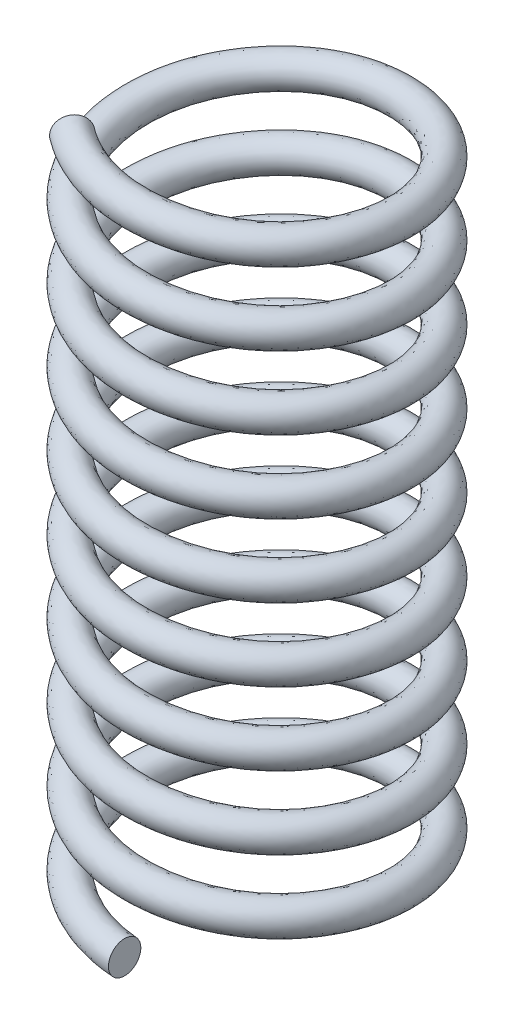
ISO-10303-21;
HEADER;
FILE_DESCRIPTION(('STEP AP214'),'2;1');
FILE_NAME('part.step','',(''),(''),'','','');
FILE_SCHEMA(('AUTOMOTIVE_DESIGN { 1 0 10303 214 1 1 1 1 }'));
ENDSEC;
DATA;
#1=APPLICATION_CONTEXT('core data for automotive mechanical design processes');
#2=APPLICATION_PROTOCOL_DEFINITION('international standard','automotive_design',2000,#1);
#3=PRODUCT_CONTEXT('',#1,'mechanical');
#4=PRODUCT('Part','Part','',(#3));
#5=PRODUCT_RELATED_PRODUCT_CATEGORY('part','',(#4));
#6=PRODUCT_DEFINITION_FORMATION('','',#4);
#7=PRODUCT_DEFINITION_CONTEXT('part definition',#1,'design');
#8=PRODUCT_DEFINITION('design','',#6,#7);
#9=PRODUCT_DEFINITION_SHAPE('','',#8);
#10=(LENGTH_UNIT() NAMED_UNIT(*) SI_UNIT(.MILLI.,.METRE.));
#11=(NAMED_UNIT(*) PLANE_ANGLE_UNIT() SI_UNIT($,.RADIAN.));
#12=(NAMED_UNIT(*) SI_UNIT($,.STERADIAN.) SOLID_ANGLE_UNIT());
#13=UNCERTAINTY_MEASURE_WITH_UNIT(LENGTH_MEASURE(1.E-05),#10,'distance_accuracy_value','');
#14=(GEOMETRIC_REPRESENTATION_CONTEXT(3) GLOBAL_UNCERTAINTY_ASSIGNED_CONTEXT((#13)) GLOBAL_UNIT_ASSIGNED_CONTEXT((#10,
#11,#12)) REPRESENTATION_CONTEXT('',''));
#15=CARTESIAN_POINT('',(0.,0.,0.));
#16=DIRECTION('',(0.,0.,1.));
#17=DIRECTION('',(1.,0.,0.));
#18=AXIS2_PLACEMENT_3D('',#15,#16,#17);
#19=CARTESIAN_POINT('',(0.,0.,2.28600000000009));
#20=DIRECTION('',(1.,0.,0.));
#21=DIRECTION('',(0.,0.,-1.00000000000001));
#22=AXIS2_PLACEMENT_3D('',#19,#20,#21);
#23=PLANE('',#22);
#24=CARTESIAN_POINT('',(0.,0.,2.28600000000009));
#25=DIRECTION('',(1.,0.,0.));
#26=DIRECTION('',(0.,0.,-1.00000000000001));
#27=AXIS2_PLACEMENT_3D('',#24,#25,#26);
#28=CIRCLE('',#27,0.2794);
#29=CARTESIAN_POINT('',(0.,0.,2.00660000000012));
#30=VERTEX_POINT('',#29);
#31=EDGE_CURVE('E38',#30,#30,#28,.T.);
#32=ORIENTED_EDGE('',*,*,#31,.T.);
#33=EDGE_LOOP('',(#32));
#34=FACE_BOUND('',#33,.T.);
#35=ADVANCED_FACE('F30',(#34),#23,.T.);
#36=CARTESIAN_POINT('',(-1.34367708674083,11.43,1.84941284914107));
#37=DIRECTION('',(0.809016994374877,0.,0.587785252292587));
#38=DIRECTION('',(0.587785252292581,0.,-0.809016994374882));
#39=AXIS2_PLACEMENT_3D('',#36,#37,#38);
#40=PLANE('',#39);
#41=CARTESIAN_POINT('',(-1.34367708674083,11.43,1.84941284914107));
#42=DIRECTION('',(0.809016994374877,0.,0.587785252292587));
#43=DIRECTION('',(0.587785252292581,0.,-0.809016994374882));
#44=AXIS2_PLACEMENT_3D('',#41,#42,#43);
#45=CIRCLE('',#44,0.2794);
#46=CARTESIAN_POINT('',(-1.17941098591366,11.4309378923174,1.62340273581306));
#47=VERTEX_POINT('',#46);
#48=EDGE_CURVE('E11',#47,#47,#45,.T.);
#49=ORIENTED_EDGE('',*,*,#48,.F.);
#50=EDGE_LOOP('',(#49));
#51=FACE_BOUND('',#50,.T.);
#52=ADVANCED_FACE('F64',(#51),#40,.F.);
#53=CARTESIAN_POINT('',(0.,0.,2.00660000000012));
#54=CARTESIAN_POINT('',(-1.15851105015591,0.104670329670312,2.00660000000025));
#55=CARTESIAN_POINT('',(-1.73776657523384,0.20934065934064,1.0033000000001));
#56=CARTESIAN_POINT('',(-2.31702210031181,0.314010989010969,0.));
#57=CARTESIAN_POINT('',(-1.73776657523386,0.418681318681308,-1.00329999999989));
#58=CARTESIAN_POINT('',(-1.15851105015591,0.523351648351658,-2.00659999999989));
#59=CARTESIAN_POINT('',(0.,0.628021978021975,-2.0065999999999));
#60=CARTESIAN_POINT('',(1.15851105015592,0.732692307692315,-2.00659999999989));
#61=CARTESIAN_POINT('',(1.73776657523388,0.837362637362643,-1.00329999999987));
#62=CARTESIAN_POINT('',(2.31702210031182,0.942032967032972,1.04160478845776E-13));
#63=CARTESIAN_POINT('',(1.73776657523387,1.04670329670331,1.00330000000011));
#64=CARTESIAN_POINT('',(1.15851105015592,1.15137362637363,2.00660000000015));
#65=CARTESIAN_POINT('',(0.,1.25604395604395,2.00660000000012));
#66=CARTESIAN_POINT('',(-1.15851105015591,1.36071428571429,2.00660000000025));
#67=CARTESIAN_POINT('',(-1.73776657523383,1.46538461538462,1.0033000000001));
#68=CARTESIAN_POINT('',(-2.31702210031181,1.57005494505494,0.));
#69=CARTESIAN_POINT('',(-1.73776657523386,1.67472527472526,-1.00329999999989));
#70=CARTESIAN_POINT('',(-1.15851105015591,1.7793956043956,-2.00659999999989));
#71=CARTESIAN_POINT('',(0.,1.88406593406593,-2.0065999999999));
#72=CARTESIAN_POINT('',(1.15851105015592,1.98873626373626,-2.00659999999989));
#73=CARTESIAN_POINT('',(1.73776657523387,2.09340659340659,-1.00329999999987));
#74=CARTESIAN_POINT('',(2.31702210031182,2.19807692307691,1.04160478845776E-13));
#75=CARTESIAN_POINT('',(1.73776657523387,2.30274725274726,1.00330000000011));
#76=CARTESIAN_POINT('',(1.15851105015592,2.40741758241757,2.00660000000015));
#77=CARTESIAN_POINT('',(0.,2.5120879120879,2.00660000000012));
#78=CARTESIAN_POINT('',(-1.15851105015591,2.61675824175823,2.00660000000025));
#79=CARTESIAN_POINT('',(-1.73776657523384,2.72142857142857,1.00330000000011));
#80=CARTESIAN_POINT('',(-2.31702210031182,2.82609890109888,0.));
#81=CARTESIAN_POINT('',(-1.73776657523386,2.93076923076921,-1.00329999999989));
#82=CARTESIAN_POINT('',(-1.15851105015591,3.03543956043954,-2.00659999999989));
#83=CARTESIAN_POINT('',(0.,3.14010989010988,-2.0065999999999));
#84=CARTESIAN_POINT('',(1.15851105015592,3.24478021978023,-2.00659999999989));
#85=CARTESIAN_POINT('',(1.73776657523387,3.34945054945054,-1.00329999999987));
#86=CARTESIAN_POINT('',(2.31702210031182,3.45412087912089,1.04160478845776E-13));
#87=CARTESIAN_POINT('',(1.73776657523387,3.55879120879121,1.00330000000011));
#88=CARTESIAN_POINT('',(1.15851105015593,3.66346153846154,2.00660000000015));
#89=CARTESIAN_POINT('',(0.,3.76813186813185,2.00660000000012));
#90=CARTESIAN_POINT('',(-1.15851105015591,3.87280219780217,2.00660000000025));
#91=CARTESIAN_POINT('',(-1.73776657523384,3.97747252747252,1.00330000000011));
#92=CARTESIAN_POINT('',(-2.31702210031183,4.08214285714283,0.));
#93=CARTESIAN_POINT('',(-1.73776657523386,4.18681318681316,-1.00329999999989));
#94=CARTESIAN_POINT('',(-1.15851105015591,4.29148351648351,-2.00659999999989));
#95=CARTESIAN_POINT('',(0.,4.39615384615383,-2.0065999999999));
#96=CARTESIAN_POINT('',(1.15851105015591,4.50082417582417,-2.00659999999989));
#97=CARTESIAN_POINT('',(1.73776657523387,4.6054945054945,-1.00329999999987));
#98=CARTESIAN_POINT('',(2.31702210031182,4.71016483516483,1.04160478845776E-13));
#99=CARTESIAN_POINT('',(1.73776657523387,4.81483516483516,1.00330000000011));
#100=CARTESIAN_POINT('',(1.15851105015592,4.91950549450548,2.00660000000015));
#101=CARTESIAN_POINT('',(0.,5.0241758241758,2.00660000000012));
#102=CARTESIAN_POINT('',(-1.15851105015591,5.12884615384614,2.00660000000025));
#103=CARTESIAN_POINT('',(-1.73776657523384,5.23351648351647,1.00330000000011));
#104=CARTESIAN_POINT('',(-2.31702210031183,5.3381868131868,0.));
#105=CARTESIAN_POINT('',(-1.73776657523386,5.44285714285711,-1.00329999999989));
#106=CARTESIAN_POINT('',(-1.15851105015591,5.54752747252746,-2.00659999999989));
#107=CARTESIAN_POINT('',(0.,5.65219780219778,-2.0065999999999));
#108=CARTESIAN_POINT('',(1.15851105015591,5.75686813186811,-2.00659999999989));
#109=CARTESIAN_POINT('',(1.73776657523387,5.86153846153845,-1.00329999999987));
#110=CARTESIAN_POINT('',(2.31702210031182,5.9662087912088,1.04160478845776E-13));
#111=CARTESIAN_POINT('',(1.73776657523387,6.07087912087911,1.00330000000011));
#112=CARTESIAN_POINT('',(1.15851105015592,6.17554945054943,2.00660000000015));
#113=CARTESIAN_POINT('',(0.,6.28021978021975,2.00660000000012));
#114=CARTESIAN_POINT('',(-1.15851105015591,6.38489010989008,2.00660000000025));
#115=CARTESIAN_POINT('',(-1.73776657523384,6.48956043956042,1.00330000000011));
#116=CARTESIAN_POINT('',(-2.31702210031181,6.59423076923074,0.));
#117=CARTESIAN_POINT('',(-1.73776657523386,6.69890109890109,-1.00329999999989));
#118=CARTESIAN_POINT('',(-1.15851105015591,6.8035714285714,-2.00659999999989));
#119=CARTESIAN_POINT('',(0.,6.90824175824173,-2.0065999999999));
#120=CARTESIAN_POINT('',(1.15851105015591,7.01291208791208,-2.00659999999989));
#121=CARTESIAN_POINT('',(1.73776657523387,7.1175824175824,-1.00329999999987));
#122=CARTESIAN_POINT('',(2.31702210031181,7.22225274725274,1.04160478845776E-13));
#123=CARTESIAN_POINT('',(1.73776657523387,7.32692307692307,1.00330000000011));
#124=CARTESIAN_POINT('',(1.15851105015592,7.4315934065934,2.00660000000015));
#125=CARTESIAN_POINT('',(0.,7.53626373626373,2.00660000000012));
#126=CARTESIAN_POINT('',(-1.15851105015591,7.64093406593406,2.00660000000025));
#127=CARTESIAN_POINT('',(-1.73776657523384,7.74560439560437,1.00330000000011));
#128=CARTESIAN_POINT('',(-2.31702210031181,7.85027472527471,0.));
#129=CARTESIAN_POINT('',(-1.73776657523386,7.95494505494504,-1.00329999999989));
#130=CARTESIAN_POINT('',(-1.15851105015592,8.05961538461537,-2.00659999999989));
#131=CARTESIAN_POINT('',(0.,8.16428571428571,-2.00659999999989));
#132=CARTESIAN_POINT('',(1.15851105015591,8.26895604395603,-2.00659999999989));
#133=CARTESIAN_POINT('',(1.73776657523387,8.37362637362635,-1.00329999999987));
#134=CARTESIAN_POINT('',(2.31702210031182,8.47829670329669,1.04160478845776E-13));
#135=CARTESIAN_POINT('',(1.73776657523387,8.58296703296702,1.00330000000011));
#136=CARTESIAN_POINT('',(1.15851105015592,8.68763736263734,2.00660000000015));
#137=CARTESIAN_POINT('',(0.,8.79230769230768,2.00660000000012));
#138=CARTESIAN_POINT('',(-1.15851105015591,8.896978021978,2.00660000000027));
#139=CARTESIAN_POINT('',(-1.73776657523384,9.00164835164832,1.00330000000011));
#140=CARTESIAN_POINT('',(-2.31702210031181,9.10631868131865,0.));
#141=CARTESIAN_POINT('',(-1.73776657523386,9.21098901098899,-1.00329999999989));
#142=CARTESIAN_POINT('',(-1.15851105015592,9.31565934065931,-2.00659999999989));
#143=CARTESIAN_POINT('',(0.,9.42032967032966,-2.00659999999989));
#144=CARTESIAN_POINT('',(1.15851105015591,9.52499999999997,-2.00659999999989));
#145=CARTESIAN_POINT('',(1.73776657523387,9.62967032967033,-1.00329999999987));
#146=CARTESIAN_POINT('',(2.31702210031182,9.73434065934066,1.04160478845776E-13));
#147=CARTESIAN_POINT('',(1.73776657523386,9.83901098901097,1.00330000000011));
#148=CARTESIAN_POINT('',(1.15851105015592,9.94368131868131,2.00660000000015));
#149=CARTESIAN_POINT('',(0.,10.0483516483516,2.00660000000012));
#150=CARTESIAN_POINT('',(-1.15851105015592,10.1530219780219,2.00660000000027));
#151=CARTESIAN_POINT('',(-1.73776657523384,10.2576923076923,1.00330000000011));
#152=CARTESIAN_POINT('',(-2.31702210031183,10.3623626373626,1.04160478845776E-13));
#153=CARTESIAN_POINT('',(-1.73776657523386,10.4670329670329,-1.00329999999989));
#154=CARTESIAN_POINT('',(-1.15851105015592,10.5717032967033,-2.00659999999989));
#155=CARTESIAN_POINT('',(0.,10.6763736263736,-2.00659999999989));
#156=CARTESIAN_POINT('',(1.15851105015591,10.7810439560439,-2.00659999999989));
#157=CARTESIAN_POINT('',(1.73776657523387,10.8857142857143,-1.00329999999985));
#158=CARTESIAN_POINT('',(2.31702210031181,10.9903846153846,1.04160478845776E-13));
#159=CARTESIAN_POINT('',(1.73776657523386,11.0950549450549,1.00330000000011));
#160=CARTESIAN_POINT('',(1.15851105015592,11.1997252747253,2.00660000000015));
#161=CARTESIAN_POINT('',(0.,11.3043956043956,2.00660000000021));
#162=CARTESIAN_POINT('',(-1.15851105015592,11.4090659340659,2.00660000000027));
#163=CARTESIAN_POINT('',(-1.73776657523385,11.5137362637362,1.00330000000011));
#164=CARTESIAN_POINT('',(-2.31702210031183,11.6184065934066,1.04160478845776E-13));
#165=CARTESIAN_POINT('',(-1.73776657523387,11.7230769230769,-1.00329999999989));
#166=CARTESIAN_POINT('',(-1.15851105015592,11.8277472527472,-2.00659999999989));
#167=CARTESIAN_POINT('',(0.,11.9324175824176,-2.00659999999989));
#168=CARTESIAN_POINT('',(1.15851105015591,12.0370879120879,-2.00659999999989));
#169=CARTESIAN_POINT('',(1.73776657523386,12.1417582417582,-1.00329999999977));
#170=CARTESIAN_POINT('',(2.31702210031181,12.2464285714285,1.04160478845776E-13));
#171=CARTESIAN_POINT('',(1.73776657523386,12.3510989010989,1.00330000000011));
#172=CARTESIAN_POINT('',(1.15851105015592,12.4557692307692,2.00660000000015));
#173=CARTESIAN_POINT('',(0.,12.5604395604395,2.00660000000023));
#174=CARTESIAN_POINT('',(0.,0.558800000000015,2.0066000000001));
#175=CARTESIAN_POINT('',(-1.15851105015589,0.663470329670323,2.00660000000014));
#176=CARTESIAN_POINT('',(-1.73776657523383,0.768140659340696,1.00330000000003));
#177=CARTESIAN_POINT('',(-2.3170221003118,0.872810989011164,2.28351819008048E-13));
#178=CARTESIAN_POINT('',(-1.73776657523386,0.977481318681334,-1.00329999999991));
#179=CARTESIAN_POINT('',(-1.15851105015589,1.08215164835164,-2.00659999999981));
#180=CARTESIAN_POINT('',(0.,1.18682197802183,-2.0066000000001));
#181=CARTESIAN_POINT('',(1.15851105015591,1.29149230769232,-2.00659999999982));
#182=CARTESIAN_POINT('',(1.73776657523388,1.39616263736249,-1.00330000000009));
#183=CARTESIAN_POINT('',(2.31702210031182,1.50083296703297,2.10324043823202E-13));
#184=CARTESIAN_POINT('',(1.73776657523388,1.60550329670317,1.00330000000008));
#185=CARTESIAN_POINT('',(1.15851105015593,1.71017362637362,2.00660000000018));
#186=CARTESIAN_POINT('',(0.,1.81484395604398,2.0066000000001));
#187=CARTESIAN_POINT('',(-1.1585110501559,1.91951428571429,2.00660000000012));
#188=CARTESIAN_POINT('',(-1.73776657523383,2.02418461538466,1.00330000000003));
#189=CARTESIAN_POINT('',(-2.31702210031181,2.12885494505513,2.28351819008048E-13));
#190=CARTESIAN_POINT('',(-1.73776657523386,2.23352527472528,-1.00329999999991));
#191=CARTESIAN_POINT('',(-1.15851105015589,2.33819560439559,-2.00659999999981));
#192=CARTESIAN_POINT('',(0.,2.44286593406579,-2.0066000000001));
#193=CARTESIAN_POINT('',(1.1585110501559,2.54753626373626,-2.00659999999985));
#194=CARTESIAN_POINT('',(1.73776657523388,2.65220659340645,-1.00330000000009));
#195=CARTESIAN_POINT('',(2.31702210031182,2.75687692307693,2.10324043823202E-13));
#196=CARTESIAN_POINT('',(1.73776657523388,2.86154725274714,1.00330000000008));
#197=CARTESIAN_POINT('',(1.15851105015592,2.96621758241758,2.00660000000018));
#198=CARTESIAN_POINT('',(0.,3.07088791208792,2.0066000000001));
#199=CARTESIAN_POINT('',(-1.1585110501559,3.17555824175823,2.00660000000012));
#200=CARTESIAN_POINT('',(-1.73776657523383,3.2802285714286,1.00330000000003));
#201=CARTESIAN_POINT('',(-2.31702210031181,3.38489890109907,2.28351819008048E-13));
#202=CARTESIAN_POINT('',(-1.73776657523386,3.48956923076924,-1.00329999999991));
#203=CARTESIAN_POINT('',(-1.15851105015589,3.59423956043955,-2.00659999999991));
#204=CARTESIAN_POINT('',(0.,3.69890989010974,-2.0066));
#205=CARTESIAN_POINT('',(1.1585110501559,3.80358021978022,-2.0066));
#206=CARTESIAN_POINT('',(1.73776657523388,3.9082505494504,-1.00330000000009));
#207=CARTESIAN_POINT('',(2.31702210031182,4.01292087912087,1.14175909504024E-13));
#208=CARTESIAN_POINT('',(1.73776657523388,4.11759120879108,1.00330000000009));
#209=CARTESIAN_POINT('',(1.15851105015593,4.22226153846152,2.00660000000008));
#210=CARTESIAN_POINT('',(0.,4.32693186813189,2.0066000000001));
#211=CARTESIAN_POINT('',(-1.15851105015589,4.4316021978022,2.00660000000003));
#212=CARTESIAN_POINT('',(-1.73776657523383,4.53627252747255,1.00330000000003));
#213=CARTESIAN_POINT('',(-2.31702210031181,4.64094285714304,1.3220368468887E-13));
#214=CARTESIAN_POINT('',(-1.73776657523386,4.74561318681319,-1.00329999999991));
#215=CARTESIAN_POINT('',(-1.15851105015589,4.85028351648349,-2.00659999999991));
#216=CARTESIAN_POINT('',(0.,4.95495384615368,-2.0066));
#217=CARTESIAN_POINT('',(1.1585110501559,5.05962417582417,-2.00659999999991));
#218=CARTESIAN_POINT('',(1.73776657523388,5.16429450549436,-1.00330000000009));
#219=CARTESIAN_POINT('',(2.31702210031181,5.26896483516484,1.14175909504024E-13));
#220=CARTESIAN_POINT('',(1.73776657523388,5.37363516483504,1.00330000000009));
#221=CARTESIAN_POINT('',(1.15851105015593,5.47830549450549,2.00660000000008));
#222=CARTESIAN_POINT('',(0.,5.58297582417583,2.0066000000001));
#223=CARTESIAN_POINT('',(-1.15851105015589,5.68764615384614,2.00660000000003));
#224=CARTESIAN_POINT('',(-1.73776657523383,5.79231648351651,1.00330000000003));
#225=CARTESIAN_POINT('',(-2.31702210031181,5.89698681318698,1.3220368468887E-13));
#226=CARTESIAN_POINT('',(-1.73776657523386,6.00165714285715,-1.00329999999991));
#227=CARTESIAN_POINT('',(-1.1585110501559,6.10632747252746,-2.00659999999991));
#228=CARTESIAN_POINT('',(0.,6.21099780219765,-2.00659999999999));
#229=CARTESIAN_POINT('',(1.1585110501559,6.31566813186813,-2.00659999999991));
#230=CARTESIAN_POINT('',(1.73776657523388,6.42033846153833,-1.00330000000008));
#231=CARTESIAN_POINT('',(2.31702210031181,6.52500879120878,1.14175909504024E-13));
#232=CARTESIAN_POINT('',(1.73776657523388,6.62967912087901,1.00330000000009));
#233=CARTESIAN_POINT('',(1.15851105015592,6.73434945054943,2.0066000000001));
#234=CARTESIAN_POINT('',(0.,6.83901978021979,2.0066000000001));
#235=CARTESIAN_POINT('',(-1.15851105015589,6.9436901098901,2.00660000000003));
#236=CARTESIAN_POINT('',(-1.73776657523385,7.04836043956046,1.00330000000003));
#237=CARTESIAN_POINT('',(-2.31702210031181,7.15303076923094,1.3220368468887E-13));
#238=CARTESIAN_POINT('',(-1.73776657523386,7.2577010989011,-1.00329999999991));
#239=CARTESIAN_POINT('',(-1.15851105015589,7.3623714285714,-2.00659999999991));
#240=CARTESIAN_POINT('',(0.,7.46704175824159,-2.00659999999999));
#241=CARTESIAN_POINT('',(1.1585110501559,7.57171208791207,-2.00659999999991));
#242=CARTESIAN_POINT('',(1.73776657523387,7.67638241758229,-1.00330000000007));
#243=CARTESIAN_POINT('',(2.31702210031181,7.78105274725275,1.14175909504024E-13));
#244=CARTESIAN_POINT('',(1.73776657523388,7.88572307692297,1.00330000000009));
#245=CARTESIAN_POINT('',(1.15851105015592,7.99039340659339,2.0066000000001));
#246=CARTESIAN_POINT('',(0.,8.09506373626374,2.0066000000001));
#247=CARTESIAN_POINT('',(-1.15851105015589,8.19973406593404,2.00660000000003));
#248=CARTESIAN_POINT('',(-1.73776657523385,8.30440439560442,1.00330000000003));
#249=CARTESIAN_POINT('',(-2.31702210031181,8.40907472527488,1.3220368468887E-13));
#250=CARTESIAN_POINT('',(-1.73776657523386,8.51374505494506,-1.00329999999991));
#251=CARTESIAN_POINT('',(-1.1585110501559,8.61841538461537,-2.00659999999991));
#252=CARTESIAN_POINT('',(0.,8.72308571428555,-2.00659999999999));
#253=CARTESIAN_POINT('',(1.1585110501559,8.82775604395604,-2.00659999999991));
#254=CARTESIAN_POINT('',(1.73776657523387,8.93242637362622,-1.00330000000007));
#255=CARTESIAN_POINT('',(2.31702210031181,9.03709670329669,1.14175909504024E-13));
#256=CARTESIAN_POINT('',(1.73776657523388,9.1417670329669,1.00330000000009));
#257=CARTESIAN_POINT('',(1.15851105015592,9.24643736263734,2.0066000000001));
#258=CARTESIAN_POINT('',(0.,9.35110769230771,2.0066000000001));
#259=CARTESIAN_POINT('',(-1.1585110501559,9.45577802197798,2.00660000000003));
#260=CARTESIAN_POINT('',(-1.73776657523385,9.56044835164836,1.00330000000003));
#261=CARTESIAN_POINT('',(-2.31702210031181,9.66511868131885,1.3220368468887E-13));
#262=CARTESIAN_POINT('',(-1.73776657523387,9.769789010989,-1.00329999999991));
#263=CARTESIAN_POINT('',(-1.1585110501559,9.87445934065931,-2.00659999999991));
#264=CARTESIAN_POINT('',(0.,9.9791296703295,-2.00659999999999));
#265=CARTESIAN_POINT('',(1.1585110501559,10.0838,-2.00659999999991));
#266=CARTESIAN_POINT('',(1.73776657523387,10.1884703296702,-1.00330000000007));
#267=CARTESIAN_POINT('',(2.31702210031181,10.2931406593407,1.14175909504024E-13));
#268=CARTESIAN_POINT('',(1.73776657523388,10.3978109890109,1.00330000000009));
#269=CARTESIAN_POINT('',(1.15851105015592,10.5024813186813,2.0066000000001));
#270=CARTESIAN_POINT('',(0.,10.6071516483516,2.0066000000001));
#271=CARTESIAN_POINT('',(-1.15851105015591,10.711821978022,2.00660000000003));
#272=CARTESIAN_POINT('',(-1.73776657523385,10.8164923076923,1.00330000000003));
#273=CARTESIAN_POINT('',(-2.31702210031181,10.9211626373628,1.3220368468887E-13));
#274=CARTESIAN_POINT('',(-1.73776657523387,11.025832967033,-1.00329999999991));
#275=CARTESIAN_POINT('',(-1.1585110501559,11.1305032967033,-2.00659999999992));
#276=CARTESIAN_POINT('',(0.,11.2351736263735,-2.00659999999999));
#277=CARTESIAN_POINT('',(1.15851105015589,11.3398439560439,-2.00659999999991));
#278=CARTESIAN_POINT('',(1.73776657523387,11.4445142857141,-1.00330000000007));
#279=CARTESIAN_POINT('',(2.31702210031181,11.5491846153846,1.26194426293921E-13));
#280=CARTESIAN_POINT('',(1.73776657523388,11.6538549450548,1.00330000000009));
#281=CARTESIAN_POINT('',(1.15851105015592,11.7585252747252,2.0066000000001));
#282=CARTESIAN_POINT('',(0.,11.8631956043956,2.0066000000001));
#283=CARTESIAN_POINT('',(-1.15851105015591,11.9678659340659,2.00660000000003));
#284=CARTESIAN_POINT('',(-1.73776657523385,12.0725362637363,1.00330000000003));
#285=CARTESIAN_POINT('',(-2.31702210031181,12.1772065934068,1.3220368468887E-13));
#286=CARTESIAN_POINT('',(-1.73776657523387,12.2818769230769,-1.00329999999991));
#287=CARTESIAN_POINT('',(-1.15851105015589,12.3865472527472,-2.00659999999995));
#288=CARTESIAN_POINT('',(0.,12.4912175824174,-2.00659999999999));
#289=CARTESIAN_POINT('',(1.15851105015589,12.5958879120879,-2.00659999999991));
#290=CARTESIAN_POINT('',(1.73776657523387,12.7005582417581,-1.00330000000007));
#291=CARTESIAN_POINT('',(2.3170221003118,12.8052285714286,1.3220368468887E-13));
#292=CARTESIAN_POINT('',(1.73776657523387,12.9098989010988,1.00330000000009));
#293=CARTESIAN_POINT('',(1.15851105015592,13.0145692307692,2.0066000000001));
#294=CARTESIAN_POINT('',(0.,13.1192395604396,2.0066000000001));
#295=CARTESIAN_POINT('',(0.,0.558800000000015,2.5654000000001));
#296=CARTESIAN_POINT('',(-1.48113438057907,0.663470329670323,2.56540000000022));
#297=CARTESIAN_POINT('',(-2.22170157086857,0.768140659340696,1.28270000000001));
#298=CARTESIAN_POINT('',(-2.96226876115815,0.872810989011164,1.14175909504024E-13));
#299=CARTESIAN_POINT('',(-2.2217015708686,0.977481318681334,-1.28269999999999));
#300=CARTESIAN_POINT('',(-1.48113438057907,1.08215164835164,-2.5654));
#301=CARTESIAN_POINT('',(0.,1.18682197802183,-2.56539999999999));
#302=CARTESIAN_POINT('',(1.48113438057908,1.29149230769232,-2.56539999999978));
#303=CARTESIAN_POINT('',(2.22170157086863,1.39616263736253,-1.28269999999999));
#304=CARTESIAN_POINT('',(2.96226876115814,1.50083296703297,2.10324043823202E-13));
#305=CARTESIAN_POINT('',(2.22170157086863,1.60550329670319,1.28270000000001));
#306=CARTESIAN_POINT('',(1.48113438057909,1.71017362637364,2.56540000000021));
#307=CARTESIAN_POINT('',(0.,1.81484395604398,2.5654000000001));
#308=CARTESIAN_POINT('',(-1.48113438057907,1.91951428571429,2.56540000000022));
#309=CARTESIAN_POINT('',(-2.22170157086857,2.02418461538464,1.28270000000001));
#310=CARTESIAN_POINT('',(-2.96226876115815,2.12885494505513,1.14175909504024E-13));
#311=CARTESIAN_POINT('',(-2.2217015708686,2.23352527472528,-1.28269999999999));
#312=CARTESIAN_POINT('',(-1.48113438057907,2.33819560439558,-2.5654));
#313=CARTESIAN_POINT('',(0.,2.44286593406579,-2.56539999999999));
#314=CARTESIAN_POINT('',(1.48113438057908,2.54753626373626,-2.56539999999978));
#315=CARTESIAN_POINT('',(2.22170157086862,2.65220659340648,-1.28269999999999));
#316=CARTESIAN_POINT('',(2.96226876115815,2.75687692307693,2.10324043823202E-13));
#317=CARTESIAN_POINT('',(2.22170157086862,2.86154725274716,1.28270000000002));
#318=CARTESIAN_POINT('',(1.48113438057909,2.96621758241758,2.56540000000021));
#319=CARTESIAN_POINT('',(0.,3.07088791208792,2.5654000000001));
#320=CARTESIAN_POINT('',(-1.48113438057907,3.17555824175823,2.56540000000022));
#321=CARTESIAN_POINT('',(-2.22170157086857,3.2802285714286,1.28270000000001));
#322=CARTESIAN_POINT('',(-2.96226876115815,3.38489890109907,1.14175909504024E-13));
#323=CARTESIAN_POINT('',(-2.2217015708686,3.48956923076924,-1.28269999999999));
#324=CARTESIAN_POINT('',(-1.48113438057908,3.59423956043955,-2.56540000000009));
#325=CARTESIAN_POINT('',(0.,3.69890989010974,-2.56539999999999));
#326=CARTESIAN_POINT('',(1.48113438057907,3.80358021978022,-2.56539999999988));
#327=CARTESIAN_POINT('',(2.22170157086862,3.90825054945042,-1.28269999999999));
#328=CARTESIAN_POINT('',(2.96226876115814,4.01292087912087,1.14175909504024E-13));
#329=CARTESIAN_POINT('',(2.22170157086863,4.1175912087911,1.28270000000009));
#330=CARTESIAN_POINT('',(1.48113438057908,4.22226153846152,2.56540000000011));
#331=CARTESIAN_POINT('',(0.,4.32693186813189,2.5654000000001));
#332=CARTESIAN_POINT('',(-1.48113438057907,4.43160219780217,2.56540000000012));
#333=CARTESIAN_POINT('',(-2.22170157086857,4.53627252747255,1.28270000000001));
#334=CARTESIAN_POINT('',(-2.96226876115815,4.64094285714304,0.));
#335=CARTESIAN_POINT('',(-2.2217015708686,4.74561318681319,-1.28269999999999));
#336=CARTESIAN_POINT('',(-1.48113438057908,4.85028351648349,-2.56540000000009));
#337=CARTESIAN_POINT('',(0.,4.9549538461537,-2.56539999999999));
#338=CARTESIAN_POINT('',(1.48113438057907,5.05962417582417,-2.56539999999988));
#339=CARTESIAN_POINT('',(2.22170157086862,5.16429450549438,-1.28269999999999));
#340=CARTESIAN_POINT('',(2.96226876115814,5.26896483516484,1.14175909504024E-13));
#341=CARTESIAN_POINT('',(2.22170157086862,5.37363516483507,1.2827000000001));
#342=CARTESIAN_POINT('',(1.48113438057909,5.47830549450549,2.56540000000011));
#343=CARTESIAN_POINT('',(0.,5.58297582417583,2.5654000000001));
#344=CARTESIAN_POINT('',(-1.48113438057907,5.68764615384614,2.56540000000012));
#345=CARTESIAN_POINT('',(-2.22170157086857,5.79231648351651,1.28270000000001));
#346=CARTESIAN_POINT('',(-2.96226876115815,5.89698681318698,0.));
#347=CARTESIAN_POINT('',(-2.2217015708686,6.00165714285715,-1.28269999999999));
#348=CARTESIAN_POINT('',(-1.48113438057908,6.10632747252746,-2.56540000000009));
#349=CARTESIAN_POINT('',(0.,6.21099780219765,-2.56539999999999));
#350=CARTESIAN_POINT('',(1.48113438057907,6.31566813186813,-2.56539999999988));
#351=CARTESIAN_POINT('',(2.22170157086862,6.42033846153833,-1.28269999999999));
#352=CARTESIAN_POINT('',(2.96226876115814,6.52500879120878,1.14175909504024E-13));
#353=CARTESIAN_POINT('',(2.22170157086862,6.62967912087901,1.2827000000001));
#354=CARTESIAN_POINT('',(1.48113438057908,6.73434945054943,2.56540000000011));
#355=CARTESIAN_POINT('',(0.,6.83901978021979,2.5654000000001));
#356=CARTESIAN_POINT('',(-1.48113438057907,6.9436901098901,2.56540000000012));
#357=CARTESIAN_POINT('',(-2.22170157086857,7.04836043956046,1.28270000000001));
#358=CARTESIAN_POINT('',(-2.96226876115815,7.15303076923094,0.));
#359=CARTESIAN_POINT('',(-2.2217015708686,7.2577010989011,-1.28269999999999));
#360=CARTESIAN_POINT('',(-1.48113438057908,7.3623714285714,-2.56540000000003));
#361=CARTESIAN_POINT('',(0.,7.46704175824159,-2.56539999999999));
#362=CARTESIAN_POINT('',(1.48113438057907,7.57171208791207,-2.56539999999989));
#363=CARTESIAN_POINT('',(2.22170157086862,7.67638241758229,-1.28269999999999));
#364=CARTESIAN_POINT('',(2.96226876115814,7.78105274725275,1.14175909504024E-13));
#365=CARTESIAN_POINT('',(2.22170157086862,7.88572307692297,1.2827000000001));
#366=CARTESIAN_POINT('',(1.48113438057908,7.99039340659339,2.56540000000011));
#367=CARTESIAN_POINT('',(0.,8.09506373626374,2.5654000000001));
#368=CARTESIAN_POINT('',(-1.48113438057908,8.19973406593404,2.56540000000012));
#369=CARTESIAN_POINT('',(-2.22170157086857,8.30440439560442,1.28270000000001));
#370=CARTESIAN_POINT('',(-2.96226876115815,8.40907472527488,1.02157392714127E-13));
#371=CARTESIAN_POINT('',(-2.2217015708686,8.51374505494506,-1.28269999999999));
#372=CARTESIAN_POINT('',(-1.48113438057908,8.61841538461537,-2.56540000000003));
#373=CARTESIAN_POINT('',(0.,8.72308571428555,-2.56539999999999));
#374=CARTESIAN_POINT('',(1.48113438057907,8.82775604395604,-2.56539999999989));
#375=CARTESIAN_POINT('',(2.22170157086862,8.93242637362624,-1.28269999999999));
#376=CARTESIAN_POINT('',(2.96226876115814,9.03709670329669,1.14175909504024E-13));
#377=CARTESIAN_POINT('',(2.22170157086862,9.14176703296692,1.2827000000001));
#378=CARTESIAN_POINT('',(1.48113438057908,9.24643736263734,2.56540000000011));
#379=CARTESIAN_POINT('',(0.,9.35110769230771,2.5654000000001));
#380=CARTESIAN_POINT('',(-1.48113438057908,9.45577802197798,2.56540000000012));
#381=CARTESIAN_POINT('',(-2.22170157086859,9.56044835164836,1.28270000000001));
#382=CARTESIAN_POINT('',(-2.96226876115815,9.66511868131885,1.14175909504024E-13));
#383=CARTESIAN_POINT('',(-2.2217015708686,9.769789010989,-1.28269999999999));
#384=CARTESIAN_POINT('',(-1.48113438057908,9.87445934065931,-2.56540000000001));
#385=CARTESIAN_POINT('',(0.,9.9791296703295,-2.56539999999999));
#386=CARTESIAN_POINT('',(1.48113438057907,10.0838,-2.56539999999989));
#387=CARTESIAN_POINT('',(2.22170157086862,10.1884703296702,-1.28269999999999));
#388=CARTESIAN_POINT('',(2.96226876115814,10.2931406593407,1.14175909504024E-13));
#389=CARTESIAN_POINT('',(2.22170157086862,10.3978109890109,1.2827000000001));
#390=CARTESIAN_POINT('',(1.48113438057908,10.5024813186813,2.56540000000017));
#391=CARTESIAN_POINT('',(0.,10.6071516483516,2.5654000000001));
#392=CARTESIAN_POINT('',(-1.48113438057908,10.711821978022,2.56540000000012));
#393=CARTESIAN_POINT('',(-2.2217015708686,10.8164923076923,1.28270000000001));
#394=CARTESIAN_POINT('',(-2.96226876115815,10.9211626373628,1.14175909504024E-13));
#395=CARTESIAN_POINT('',(-2.2217015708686,11.0258329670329,-1.28269999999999));
#396=CARTESIAN_POINT('',(-1.4811343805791,11.1305032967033,-2.56540000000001));
#397=CARTESIAN_POINT('',(0.,11.2351736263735,-2.56539999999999));
#398=CARTESIAN_POINT('',(1.48113438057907,11.3398439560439,-2.56539999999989));
#399=CARTESIAN_POINT('',(2.22170157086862,11.4445142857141,-1.28269999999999));
#400=CARTESIAN_POINT('',(2.96226876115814,11.5491846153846,1.14175909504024E-13));
#401=CARTESIAN_POINT('',(2.22170157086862,11.6538549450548,1.2827000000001));
#402=CARTESIAN_POINT('',(1.48113438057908,11.7585252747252,2.56540000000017));
#403=CARTESIAN_POINT('',(0.,11.8631956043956,2.5654000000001));
#404=CARTESIAN_POINT('',(-1.48113438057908,11.9678659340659,2.56540000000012));
#405=CARTESIAN_POINT('',(-2.2217015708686,12.0725362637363,1.2827000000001));
#406=CARTESIAN_POINT('',(-2.96226876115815,12.1772065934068,1.14175909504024E-13));
#407=CARTESIAN_POINT('',(-2.2217015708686,12.2818769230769,-1.28269999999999));
#408=CARTESIAN_POINT('',(-1.4811343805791,12.3865472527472,-2.56540000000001));
#409=CARTESIAN_POINT('',(0.,12.4912175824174,-2.56539999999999));
#410=CARTESIAN_POINT('',(1.48113438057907,12.5958879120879,-2.56539999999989));
#411=CARTESIAN_POINT('',(2.22170157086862,12.7005582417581,-1.28269999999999));
#412=CARTESIAN_POINT('',(2.96226876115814,12.8052285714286,1.3220368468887E-13));
#413=CARTESIAN_POINT('',(2.22170157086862,12.9098989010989,1.2827000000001));
#414=CARTESIAN_POINT('',(1.48113438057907,13.0145692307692,2.56540000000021));
#415=CARTESIAN_POINT('',(0.,13.1192395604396,2.5654000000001));
#416=CARTESIAN_POINT('',(0.,0.,2.56540000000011));
#417=CARTESIAN_POINT('',(-1.48113438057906,0.104670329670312,2.56540000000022));
#418=CARTESIAN_POINT('',(-2.2217015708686,0.20934065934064,1.28270000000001));
#419=CARTESIAN_POINT('',(-2.96226876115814,0.314010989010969,1.04160478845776E-13));
#420=CARTESIAN_POINT('',(-2.22170157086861,0.418681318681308,-1.2827));
#421=CARTESIAN_POINT('',(-1.48113438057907,0.523351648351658,-2.56539999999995));
#422=CARTESIAN_POINT('',(0.,0.628021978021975,-2.5654));
#423=CARTESIAN_POINT('',(1.48113438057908,0.732692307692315,-2.56539999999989));
#424=CARTESIAN_POINT('',(2.22170157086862,0.837362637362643,-1.28270000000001));
#425=CARTESIAN_POINT('',(2.96226876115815,0.942032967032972,1.36209856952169E-13));
#426=CARTESIAN_POINT('',(2.22170157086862,1.04670329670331,1.28270000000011));
#427=CARTESIAN_POINT('',(1.48113438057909,1.15137362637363,2.56540000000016));
#428=CARTESIAN_POINT('',(0.,1.25604395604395,2.56540000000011));
#429=CARTESIAN_POINT('',(-1.48113438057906,1.36071428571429,2.5654000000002));
#430=CARTESIAN_POINT('',(-2.2217015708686,1.46538461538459,1.28270000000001));
#431=CARTESIAN_POINT('',(-2.96226876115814,1.57005494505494,1.04160478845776E-13));
#432=CARTESIAN_POINT('',(-2.2217015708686,1.67472527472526,-1.2827));
#433=CARTESIAN_POINT('',(-1.48113438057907,1.7793956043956,-2.56539999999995));
#434=CARTESIAN_POINT('',(0.,1.88406593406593,-2.5654));
#435=CARTESIAN_POINT('',(1.48113438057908,1.98873626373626,-2.56539999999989));
#436=CARTESIAN_POINT('',(2.22170157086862,2.09340659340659,-1.28270000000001));
#437=CARTESIAN_POINT('',(2.96226876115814,2.19807692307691,1.36209856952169E-13));
#438=CARTESIAN_POINT('',(2.22170157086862,2.30274725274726,1.28270000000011));
#439=CARTESIAN_POINT('',(1.48113438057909,2.40741758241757,2.56540000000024));
#440=CARTESIAN_POINT('',(0.,2.5120879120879,2.56540000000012));
#441=CARTESIAN_POINT('',(-1.48113438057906,2.61675824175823,2.56540000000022));
#442=CARTESIAN_POINT('',(-2.2217015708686,2.72142857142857,1.28270000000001));
#443=CARTESIAN_POINT('',(-2.96226876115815,2.82609890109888,1.04160478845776E-13));
#444=CARTESIAN_POINT('',(-2.22170157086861,2.93076923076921,-1.2827));
#445=CARTESIAN_POINT('',(-1.48113438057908,3.03543956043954,-2.56539999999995));
#446=CARTESIAN_POINT('',(0.,3.14010989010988,-2.5654));
#447=CARTESIAN_POINT('',(1.48113438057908,3.24478021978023,-2.56539999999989));
#448=CARTESIAN_POINT('',(2.22170157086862,3.34945054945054,-1.28270000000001));
#449=CARTESIAN_POINT('',(2.96226876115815,3.45412087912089,1.36209856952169E-13));
#450=CARTESIAN_POINT('',(2.22170157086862,3.55879120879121,1.28270000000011));
#451=CARTESIAN_POINT('',(1.48113438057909,3.66346153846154,2.56540000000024));
#452=CARTESIAN_POINT('',(0.,3.76813186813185,2.56540000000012));
#453=CARTESIAN_POINT('',(-1.48113438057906,3.87280219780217,2.56540000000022));
#454=CARTESIAN_POINT('',(-2.2217015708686,3.97747252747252,1.28270000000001));
#455=CARTESIAN_POINT('',(-2.96226876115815,4.08214285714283,1.04160478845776E-13));
#456=CARTESIAN_POINT('',(-2.2217015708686,4.18681318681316,-1.2827));
#457=CARTESIAN_POINT('',(-1.48113438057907,4.29148351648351,-2.56539999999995));
#458=CARTESIAN_POINT('',(0.,4.39615384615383,-2.5654));
#459=CARTESIAN_POINT('',(1.48113438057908,4.50082417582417,-2.56539999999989));
#460=CARTESIAN_POINT('',(2.22170157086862,4.6054945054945,-1.28270000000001));
#461=CARTESIAN_POINT('',(2.96226876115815,4.71016483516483,1.36209856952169E-13));
#462=CARTESIAN_POINT('',(2.22170157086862,4.81483516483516,1.28270000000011));
#463=CARTESIAN_POINT('',(1.48113438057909,4.91950549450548,2.56540000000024));
#464=CARTESIAN_POINT('',(0.,5.0241758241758,2.56540000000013));
#465=CARTESIAN_POINT('',(-1.48113438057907,5.12884615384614,2.56540000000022));
#466=CARTESIAN_POINT('',(-2.2217015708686,5.23351648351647,1.28270000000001));
#467=CARTESIAN_POINT('',(-2.96226876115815,5.3381868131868,1.04160478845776E-13));
#468=CARTESIAN_POINT('',(-2.22170157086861,5.44285714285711,-1.2827));
#469=CARTESIAN_POINT('',(-1.48113438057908,5.54752747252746,-2.56539999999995));
#470=CARTESIAN_POINT('',(0.,5.65219780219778,-2.5654));
#471=CARTESIAN_POINT('',(1.48113438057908,5.75686813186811,-2.56539999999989));
#472=CARTESIAN_POINT('',(2.22170157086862,5.86153846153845,-1.28270000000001));
#473=CARTESIAN_POINT('',(2.96226876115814,5.9662087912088,1.36209856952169E-13));
#474=CARTESIAN_POINT('',(2.22170157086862,6.07087912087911,1.28270000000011));
#475=CARTESIAN_POINT('',(1.48113438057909,6.17554945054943,2.56540000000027));
#476=CARTESIAN_POINT('',(0.,6.28021978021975,2.56540000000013));
#477=CARTESIAN_POINT('',(-1.48113438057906,6.38489010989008,2.56540000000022));
#478=CARTESIAN_POINT('',(-2.2217015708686,6.48956043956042,1.28270000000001));
#479=CARTESIAN_POINT('',(-2.96226876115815,6.59423076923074,0.));
#480=CARTESIAN_POINT('',(-2.2217015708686,6.69890109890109,-1.2827));
#481=CARTESIAN_POINT('',(-1.48113438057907,6.8035714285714,-2.56539999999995));
#482=CARTESIAN_POINT('',(0.,6.90824175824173,-2.5654));
#483=CARTESIAN_POINT('',(1.48113438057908,7.01291208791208,-2.56539999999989));
#484=CARTESIAN_POINT('',(2.22170157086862,7.1175824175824,-1.2827));
#485=CARTESIAN_POINT('',(2.96226876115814,7.22225274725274,1.36209856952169E-13));
#486=CARTESIAN_POINT('',(2.22170157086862,7.32692307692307,1.28270000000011));
#487=CARTESIAN_POINT('',(1.48113438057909,7.4315934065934,2.56540000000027));
#488=CARTESIAN_POINT('',(0.,7.53626373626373,2.56540000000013));
#489=CARTESIAN_POINT('',(-1.48113438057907,7.64093406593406,2.56540000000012));
#490=CARTESIAN_POINT('',(-2.2217015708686,7.74560439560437,1.28270000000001));
#491=CARTESIAN_POINT('',(-2.96226876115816,7.85027472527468,0.));
#492=CARTESIAN_POINT('',(-2.22170157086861,7.95494505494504,-1.2827));
#493=CARTESIAN_POINT('',(-1.48113438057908,8.05961538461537,-2.56539999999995));
#494=CARTESIAN_POINT('',(0.,8.16428571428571,-2.5654));
#495=CARTESIAN_POINT('',(1.48113438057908,8.26895604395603,-2.56539999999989));
#496=CARTESIAN_POINT('',(2.22170157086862,8.37362637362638,-1.2827));
#497=CARTESIAN_POINT('',(2.96226876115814,8.47829670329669,1.36209856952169E-13));
#498=CARTESIAN_POINT('',(2.22170157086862,8.58296703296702,1.28270000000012));
#499=CARTESIAN_POINT('',(1.48113438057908,8.68763736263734,2.56540000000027));
#500=CARTESIAN_POINT('',(0.,8.79230769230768,2.56540000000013));
#501=CARTESIAN_POINT('',(-1.48113438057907,8.896978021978,2.56540000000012));
#502=CARTESIAN_POINT('',(-2.2217015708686,9.00164835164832,1.28270000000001));
#503=CARTESIAN_POINT('',(-2.96226876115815,9.10631868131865,1.36209856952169E-13));
#504=CARTESIAN_POINT('',(-2.22170157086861,9.21098901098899,-1.2827));
#505=CARTESIAN_POINT('',(-1.48113438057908,9.31565934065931,-2.56539999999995));
#506=CARTESIAN_POINT('',(0.,9.42032967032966,-2.5654));
#507=CARTESIAN_POINT('',(1.48113438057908,9.52499999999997,-2.56539999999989));
#508=CARTESIAN_POINT('',(2.22170157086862,9.62967032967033,-1.2827));
#509=CARTESIAN_POINT('',(2.96226876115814,9.73434065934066,1.36209856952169E-13));
#510=CARTESIAN_POINT('',(2.22170157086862,9.83901098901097,1.28270000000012));
#511=CARTESIAN_POINT('',(1.48113438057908,9.94368131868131,2.56540000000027));
#512=CARTESIAN_POINT('',(0.,10.0483516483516,2.56540000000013));
#513=CARTESIAN_POINT('',(-1.48113438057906,10.1530219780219,2.56540000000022));
#514=CARTESIAN_POINT('',(-2.2217015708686,10.2576923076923,1.28270000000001));
#515=CARTESIAN_POINT('',(-2.96226876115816,10.3623626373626,1.52234546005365E-13));
#516=CARTESIAN_POINT('',(-2.22170157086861,10.4670329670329,-1.2827));
#517=CARTESIAN_POINT('',(-1.48113438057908,10.5717032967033,-2.56539999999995));
#518=CARTESIAN_POINT('',(0.,10.6763736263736,-2.5654));
#519=CARTESIAN_POINT('',(1.48113438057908,10.7810439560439,-2.56539999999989));
#520=CARTESIAN_POINT('',(2.22170157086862,10.8857142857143,-1.2827));
#521=CARTESIAN_POINT('',(2.96226876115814,10.9903846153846,1.36209856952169E-13));
#522=CARTESIAN_POINT('',(2.22170157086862,11.0950549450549,1.28270000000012));
#523=CARTESIAN_POINT('',(1.48113438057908,11.1997252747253,2.56540000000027));
#524=CARTESIAN_POINT('',(0.,11.3043956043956,2.56540000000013));
#525=CARTESIAN_POINT('',(-1.48113438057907,11.4090659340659,2.56540000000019));
#526=CARTESIAN_POINT('',(-2.2217015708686,11.5137362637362,1.28270000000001));
#527=CARTESIAN_POINT('',(-2.96226876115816,11.6184065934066,1.52234546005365E-13));
#528=CARTESIAN_POINT('',(-2.2217015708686,11.7230769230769,-1.2827));
#529=CARTESIAN_POINT('',(-1.48113438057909,11.8277472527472,-2.56539999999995));
#530=CARTESIAN_POINT('',(0.,11.9324175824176,-2.5654));
#531=CARTESIAN_POINT('',(1.48113438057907,12.0370879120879,-2.56539999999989));
#532=CARTESIAN_POINT('',(2.22170157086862,12.1417582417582,-1.2827));
#533=CARTESIAN_POINT('',(2.96226876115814,12.2464285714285,1.36209856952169E-13));
#534=CARTESIAN_POINT('',(2.22170157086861,12.3510989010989,1.28270000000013));
#535=CARTESIAN_POINT('',(1.48113438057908,12.4557692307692,2.56540000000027));
#536=CARTESIAN_POINT('',(0.,12.5604395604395,2.56540000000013));
#537=CARTESIAN_POINT('',(0.,-0.558799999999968,2.5654000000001));
#538=CARTESIAN_POINT('',(-1.48113438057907,-0.454129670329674,2.56540000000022));
#539=CARTESIAN_POINT('',(-2.22170157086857,-0.349459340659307,1.28270000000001));
#540=CARTESIAN_POINT('',(-2.96226876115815,-0.244789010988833,1.14175909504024E-13));
#541=CARTESIAN_POINT('',(-2.2217015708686,-0.14011868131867,-1.28269999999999));
#542=CARTESIAN_POINT('',(-1.48113438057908,-0.0354483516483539,-2.5654));
#543=CARTESIAN_POINT('',(0.,0.0692219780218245,-2.56539999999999));
#544=CARTESIAN_POINT('',(1.48113438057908,0.173892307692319,-2.56539999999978));
#545=CARTESIAN_POINT('',(2.22170157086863,0.278562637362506,-1.28269999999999));
#546=CARTESIAN_POINT('',(2.96226876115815,0.383232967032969,2.10324043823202E-13));
#547=CARTESIAN_POINT('',(2.22170157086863,0.487903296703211,1.28270000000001));
#548=CARTESIAN_POINT('',(1.48113438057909,0.592573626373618,2.56540000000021));
#549=CARTESIAN_POINT('',(0.,0.697243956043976,2.5654000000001));
#550=CARTESIAN_POINT('',(-1.48113438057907,0.801914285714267,2.56540000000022));
#551=CARTESIAN_POINT('',(-2.22170157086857,0.906584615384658,1.28270000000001));
#552=CARTESIAN_POINT('',(-2.96226876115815,1.01125494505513,1.14175909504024E-13));
#553=CARTESIAN_POINT('',(-2.2217015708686,1.1159252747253,-1.28269999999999));
#554=CARTESIAN_POINT('',(-1.48113438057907,1.22059560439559,-2.5654));
#555=CARTESIAN_POINT('',(0.,1.32526593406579,-2.56539999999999));
#556=CARTESIAN_POINT('',(1.48113438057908,1.42993626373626,-2.56539999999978));
#557=CARTESIAN_POINT('',(2.22170157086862,1.53460659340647,-1.28269999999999));
#558=CARTESIAN_POINT('',(2.96226876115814,1.63927692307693,2.10324043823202E-13));
#559=CARTESIAN_POINT('',(2.22170157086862,1.74394725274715,1.28270000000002));
#560=CARTESIAN_POINT('',(1.48113438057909,1.84861758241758,2.56540000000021));
#561=CARTESIAN_POINT('',(0.,1.95328791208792,2.5654000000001));
#562=CARTESIAN_POINT('',(-1.48113438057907,2.05795824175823,2.56540000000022));
#563=CARTESIAN_POINT('',(-2.22170157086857,2.1626285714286,1.28270000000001));
#564=CARTESIAN_POINT('',(-2.96226876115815,2.26729890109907,1.14175909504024E-13));
#565=CARTESIAN_POINT('',(-2.2217015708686,2.37196923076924,-1.28269999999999));
#566=CARTESIAN_POINT('',(-1.48113438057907,2.47663956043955,-2.5654));
#567=CARTESIAN_POINT('',(0.,2.58130989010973,-2.56539999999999));
#568=CARTESIAN_POINT('',(1.48113438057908,2.68598021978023,-2.56539999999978));
#569=CARTESIAN_POINT('',(2.22170157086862,2.79065054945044,-1.28269999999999));
#570=CARTESIAN_POINT('',(2.96226876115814,2.89532087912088,2.10324043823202E-13));
#571=CARTESIAN_POINT('',(2.22170157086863,2.9999912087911,1.28270000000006));
#572=CARTESIAN_POINT('',(1.48113438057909,3.10466153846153,2.56540000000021));
#573=CARTESIAN_POINT('',(0.,3.20933186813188,2.5654000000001));
#574=CARTESIAN_POINT('',(-1.48113438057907,3.31400219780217,2.56540000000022));
#575=CARTESIAN_POINT('',(-2.22170157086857,3.41867252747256,1.28270000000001));
#576=CARTESIAN_POINT('',(-2.96226876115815,3.52334285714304,0.));
#577=CARTESIAN_POINT('',(-2.2217015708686,3.62801318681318,-1.28269999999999));
#578=CARTESIAN_POINT('',(-1.48113438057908,3.7326835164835,-2.56540000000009));
#579=CARTESIAN_POINT('',(0.,3.8373538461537,-2.56539999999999));
#580=CARTESIAN_POINT('',(1.48113438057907,3.94202417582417,-2.56539999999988));
#581=CARTESIAN_POINT('',(2.22170157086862,4.04669450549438,-1.28269999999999));
#582=CARTESIAN_POINT('',(2.96226876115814,4.15136483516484,1.14175909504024E-13));
#583=CARTESIAN_POINT('',(2.22170157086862,4.25603516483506,1.2827000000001));
#584=CARTESIAN_POINT('',(1.48113438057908,4.36070549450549,2.56540000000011));
#585=CARTESIAN_POINT('',(0.,4.46537582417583,2.5654000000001));
#586=CARTESIAN_POINT('',(-1.48113438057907,4.57004615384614,2.56540000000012));
#587=CARTESIAN_POINT('',(-2.22170157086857,4.67471648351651,1.28270000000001));
#588=CARTESIAN_POINT('',(-2.96226876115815,4.77938681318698,0.));
#589=CARTESIAN_POINT('',(-2.2217015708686,4.88405714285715,-1.28269999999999));
#590=CARTESIAN_POINT('',(-1.48113438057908,4.98872747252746,-2.56540000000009));
#591=CARTESIAN_POINT('',(0.,5.09339780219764,-2.56539999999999));
#592=CARTESIAN_POINT('',(1.48113438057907,5.19806813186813,-2.56539999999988));
#593=CARTESIAN_POINT('',(2.22170157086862,5.30273846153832,-1.28269999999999));
#594=CARTESIAN_POINT('',(2.96226876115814,5.40740879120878,1.14175909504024E-13));
#595=CARTESIAN_POINT('',(2.22170157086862,5.51207912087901,1.2827000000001));
#596=CARTESIAN_POINT('',(1.48113438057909,5.61674945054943,2.56540000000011));
#597=CARTESIAN_POINT('',(0.,5.72141978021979,2.5654000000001));
#598=CARTESIAN_POINT('',(-1.48113438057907,5.82609010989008,2.56540000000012));
#599=CARTESIAN_POINT('',(-2.22170157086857,5.93076043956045,1.28270000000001));
#600=CARTESIAN_POINT('',(-2.96226876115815,6.03543076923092,0.));
#601=CARTESIAN_POINT('',(-2.2217015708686,6.14010109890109,-1.28269999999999));
#602=CARTESIAN_POINT('',(-1.48113438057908,6.2447714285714,-2.56540000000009));
#603=CARTESIAN_POINT('',(0.,6.34944175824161,-2.56539999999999));
#604=CARTESIAN_POINT('',(1.48113438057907,6.45411208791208,-2.56539999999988));
#605=CARTESIAN_POINT('',(2.22170157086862,6.55878241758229,-1.28269999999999));
#606=CARTESIAN_POINT('',(2.96226876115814,6.66345274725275,1.14175909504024E-13));
#607=CARTESIAN_POINT('',(2.22170157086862,6.76812307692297,1.2827000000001));
#608=CARTESIAN_POINT('',(1.48113438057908,6.8727934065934,2.56540000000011));
#609=CARTESIAN_POINT('',(0.,6.97746373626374,2.5654000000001));
#610=CARTESIAN_POINT('',(-1.48113438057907,7.08213406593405,2.56540000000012));
#611=CARTESIAN_POINT('',(-2.22170157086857,7.18680439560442,1.28270000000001));
#612=CARTESIAN_POINT('',(-2.96226876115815,7.29147472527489,0.));
#613=CARTESIAN_POINT('',(-2.2217015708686,7.39614505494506,-1.28269999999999));
#614=CARTESIAN_POINT('',(-1.48113438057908,7.50081538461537,-2.56540000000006));
#615=CARTESIAN_POINT('',(0.,7.60548571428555,-2.56539999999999));
#616=CARTESIAN_POINT('',(1.48113438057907,7.71015604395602,-2.56539999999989));
#617=CARTESIAN_POINT('',(2.22170157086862,7.81482637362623,-1.28269999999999));
#618=CARTESIAN_POINT('',(2.96226876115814,7.91949670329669,1.14175909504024E-13));
#619=CARTESIAN_POINT('',(2.22170157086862,8.02416703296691,1.2827000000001));
#620=CARTESIAN_POINT('',(1.48113438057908,8.12883736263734,2.56540000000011));
#621=CARTESIAN_POINT('',(0.,8.2335076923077,2.5654000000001));
#622=CARTESIAN_POINT('',(-1.48113438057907,8.33817802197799,2.56540000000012));
#623=CARTESIAN_POINT('',(-2.22170157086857,8.44284835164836,1.28270000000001));
#624=CARTESIAN_POINT('',(-2.96226876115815,8.54751868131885,1.02157392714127E-13));
#625=CARTESIAN_POINT('',(-2.2217015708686,8.652189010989,-1.28269999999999));
#626=CARTESIAN_POINT('',(-1.48113438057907,8.75685934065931,-2.56540000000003));
#627=CARTESIAN_POINT('',(0.,8.86152967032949,-2.56539999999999));
#628=CARTESIAN_POINT('',(1.48113438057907,8.96619999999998,-2.56539999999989));
#629=CARTESIAN_POINT('',(2.22170157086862,9.0708703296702,-1.28269999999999));
#630=CARTESIAN_POINT('',(2.96226876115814,9.17554065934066,1.14175909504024E-13));
#631=CARTESIAN_POINT('',(2.22170157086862,9.28021098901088,1.2827000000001));
#632=CARTESIAN_POINT('',(1.48113438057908,9.38488131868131,2.56540000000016));
#633=CARTESIAN_POINT('',(0.,9.48955164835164,2.5654000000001));
#634=CARTESIAN_POINT('',(-1.48113438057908,9.59422197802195,2.56540000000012));
#635=CARTESIAN_POINT('',(-2.22170157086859,9.69889230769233,1.28270000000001));
#636=CARTESIAN_POINT('',(-2.96226876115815,9.80356263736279,1.14175909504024E-13));
#637=CARTESIAN_POINT('',(-2.2217015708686,9.90823296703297,-1.28269999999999));
#638=CARTESIAN_POINT('',(-1.48113438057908,10.0129032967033,-2.56540000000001));
#639=CARTESIAN_POINT('',(0.,10.1175736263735,-2.56539999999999));
#640=CARTESIAN_POINT('',(1.48113438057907,10.2222439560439,-2.56539999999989));
#641=CARTESIAN_POINT('',(2.22170157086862,10.3269142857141,-1.28269999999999));
#642=CARTESIAN_POINT('',(2.96226876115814,10.4315846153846,1.14175909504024E-13));
#643=CARTESIAN_POINT('',(2.22170157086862,10.5362549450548,1.2827000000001));
#644=CARTESIAN_POINT('',(1.48113438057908,10.6409252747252,2.56540000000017));
#645=CARTESIAN_POINT('',(0.,10.7455956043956,2.5654000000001));
#646=CARTESIAN_POINT('',(-1.48113438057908,10.8502659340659,2.56540000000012));
#647=CARTESIAN_POINT('',(-2.2217015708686,10.9549362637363,1.2827000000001));
#648=CARTESIAN_POINT('',(-2.96226876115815,11.0596065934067,1.14175909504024E-13));
#649=CARTESIAN_POINT('',(-2.2217015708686,11.1642769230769,-1.28269999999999));
#650=CARTESIAN_POINT('',(-1.4811343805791,11.2689472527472,-2.56540000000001));
#651=CARTESIAN_POINT('',(0.,11.3736175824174,-2.56539999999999));
#652=CARTESIAN_POINT('',(1.48113438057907,11.4782879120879,-2.56539999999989));
#653=CARTESIAN_POINT('',(2.22170157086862,11.5829582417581,-1.28269999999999));
#654=CARTESIAN_POINT('',(2.96226876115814,11.6876285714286,1.14175909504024E-13));
#655=CARTESIAN_POINT('',(2.22170157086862,11.7922989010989,1.2827000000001));
#656=CARTESIAN_POINT('',(1.48113438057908,11.8969692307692,2.56540000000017));
#657=CARTESIAN_POINT('',(0.,12.0016395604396,2.5654000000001));
#658=CARTESIAN_POINT('',(0.,-0.558799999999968,2.0066000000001));
#659=CARTESIAN_POINT('',(-1.15851105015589,-0.454129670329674,2.00660000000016));
#660=CARTESIAN_POINT('',(-1.73776657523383,-0.349459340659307,1.00330000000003));
#661=CARTESIAN_POINT('',(-2.3170221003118,-0.244789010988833,2.28351819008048E-13));
#662=CARTESIAN_POINT('',(-1.73776657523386,-0.14011868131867,-1.00329999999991));
#663=CARTESIAN_POINT('',(-1.15851105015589,-0.0354483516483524,-2.00659999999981));
#664=CARTESIAN_POINT('',(0.,0.0692219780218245,-2.00660000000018));
#665=CARTESIAN_POINT('',(1.15851105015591,0.173892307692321,-2.00659999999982));
#666=CARTESIAN_POINT('',(1.73776657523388,0.278562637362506,-1.00330000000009));
#667=CARTESIAN_POINT('',(2.31702210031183,0.383232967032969,2.10324043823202E-13));
#668=CARTESIAN_POINT('',(1.73776657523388,0.487903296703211,1.00330000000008));
#669=CARTESIAN_POINT('',(1.15851105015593,0.592573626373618,2.00660000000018));
#670=CARTESIAN_POINT('',(0.,0.697243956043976,2.0066000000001));
#671=CARTESIAN_POINT('',(-1.1585110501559,0.801914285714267,2.00660000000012));
#672=CARTESIAN_POINT('',(-1.73776657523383,0.906584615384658,1.00330000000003));
#673=CARTESIAN_POINT('',(-2.31702210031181,1.01125494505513,2.28351819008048E-13));
#674=CARTESIAN_POINT('',(-1.73776657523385,1.1159252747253,-1.00329999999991));
#675=CARTESIAN_POINT('',(-1.15851105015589,1.22059560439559,-2.00659999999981));
#676=CARTESIAN_POINT('',(0.,1.32526593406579,-2.0066000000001));
#677=CARTESIAN_POINT('',(1.1585110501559,1.42993626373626,-2.00659999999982));
#678=CARTESIAN_POINT('',(1.73776657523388,1.53460659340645,-1.00330000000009));
#679=CARTESIAN_POINT('',(2.31702210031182,1.63927692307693,2.10324043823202E-13));
#680=CARTESIAN_POINT('',(1.73776657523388,1.74394725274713,1.00330000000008));
#681=CARTESIAN_POINT('',(1.15851105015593,1.84861758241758,2.00660000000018));
#682=CARTESIAN_POINT('',(0.,1.95328791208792,2.0066000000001));
#683=CARTESIAN_POINT('',(-1.15851105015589,2.05795824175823,2.00660000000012));
#684=CARTESIAN_POINT('',(-1.73776657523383,2.1626285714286,1.00330000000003));
#685=CARTESIAN_POINT('',(-2.31702210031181,2.26729890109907,2.28351819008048E-13));
#686=CARTESIAN_POINT('',(-1.73776657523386,2.37196923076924,-1.00329999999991));
#687=CARTESIAN_POINT('',(-1.15851105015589,2.47663956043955,-2.00659999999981));
#688=CARTESIAN_POINT('',(0.,2.58130989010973,-2.0066000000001));
#689=CARTESIAN_POINT('',(1.1585110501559,2.68598021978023,-2.00659999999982));
#690=CARTESIAN_POINT('',(1.73776657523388,2.79065054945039,-1.00330000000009));
#691=CARTESIAN_POINT('',(2.31702210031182,2.89532087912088,2.10324043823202E-13));
#692=CARTESIAN_POINT('',(1.73776657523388,2.99999120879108,1.00330000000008));
#693=CARTESIAN_POINT('',(1.15851105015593,3.10466153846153,2.00660000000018));
#694=CARTESIAN_POINT('',(0.,3.20933186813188,2.0066000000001));
#695=CARTESIAN_POINT('',(-1.1585110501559,3.31400219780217,2.00660000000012));
#696=CARTESIAN_POINT('',(-1.73776657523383,3.41867252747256,1.00330000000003));
#697=CARTESIAN_POINT('',(-2.31702210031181,3.52334285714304,1.3220368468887E-13));
#698=CARTESIAN_POINT('',(-1.73776657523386,3.6280131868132,-1.00329999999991));
#699=CARTESIAN_POINT('',(-1.15851105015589,3.7326835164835,-2.00659999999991));
#700=CARTESIAN_POINT('',(0.,3.8373538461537,-2.0066));
#701=CARTESIAN_POINT('',(1.1585110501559,3.94202417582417,-2.0066));
#702=CARTESIAN_POINT('',(1.73776657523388,4.04669450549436,-1.00330000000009));
#703=CARTESIAN_POINT('',(2.31702210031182,4.15136483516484,1.14175909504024E-13));
#704=CARTESIAN_POINT('',(1.73776657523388,4.25603516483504,1.00330000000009));
#705=CARTESIAN_POINT('',(1.15851105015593,4.36070549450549,2.00660000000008));
#706=CARTESIAN_POINT('',(0.,4.46537582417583,2.0066000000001));
#707=CARTESIAN_POINT('',(-1.15851105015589,4.57004615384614,2.00660000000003));
#708=CARTESIAN_POINT('',(-1.73776657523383,4.67471648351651,1.00330000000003));
#709=CARTESIAN_POINT('',(-2.31702210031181,4.77938681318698,1.3220368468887E-13));
#710=CARTESIAN_POINT('',(-1.73776657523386,4.88405714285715,-1.00329999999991));
#711=CARTESIAN_POINT('',(-1.15851105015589,4.98872747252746,-2.00659999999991));
#712=CARTESIAN_POINT('',(0.,5.09339780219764,-2.0066));
#713=CARTESIAN_POINT('',(1.1585110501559,5.19806813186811,-2.00659999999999));
#714=CARTESIAN_POINT('',(1.73776657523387,5.3027384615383,-1.00330000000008));
#715=CARTESIAN_POINT('',(2.31702210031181,5.40740879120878,1.14175909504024E-13));
#716=CARTESIAN_POINT('',(1.73776657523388,5.51207912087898,1.00330000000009));
#717=CARTESIAN_POINT('',(1.15851105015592,5.61674945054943,2.00660000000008));
#718=CARTESIAN_POINT('',(0.,5.72141978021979,2.0066000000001));
#719=CARTESIAN_POINT('',(-1.1585110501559,5.82609010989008,2.00660000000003));
#720=CARTESIAN_POINT('',(-1.73776657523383,5.93076043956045,1.00330000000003));
#721=CARTESIAN_POINT('',(-2.31702210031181,6.03543076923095,1.3220368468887E-13));
#722=CARTESIAN_POINT('',(-1.73776657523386,6.14010109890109,-1.00329999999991));
#723=CARTESIAN_POINT('',(-1.15851105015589,6.2447714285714,-2.00659999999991));
#724=CARTESIAN_POINT('',(0.,6.34944175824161,-2.00659999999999));
#725=CARTESIAN_POINT('',(1.1585110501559,6.45411208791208,-2.00659999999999));
#726=CARTESIAN_POINT('',(1.73776657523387,6.55878241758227,-1.00330000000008));
#727=CARTESIAN_POINT('',(2.31702210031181,6.66345274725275,1.14175909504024E-13));
#728=CARTESIAN_POINT('',(1.73776657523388,6.76812307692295,1.00330000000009));
#729=CARTESIAN_POINT('',(1.15851105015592,6.8727934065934,2.0066000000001));
#730=CARTESIAN_POINT('',(0.,6.97746373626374,2.0066000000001));
#731=CARTESIAN_POINT('',(-1.1585110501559,7.08213406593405,2.00660000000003));
#732=CARTESIAN_POINT('',(-1.73776657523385,7.18680439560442,1.00330000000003));
#733=CARTESIAN_POINT('',(-2.31702210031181,7.29147472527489,1.3220368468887E-13));
#734=CARTESIAN_POINT('',(-1.73776657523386,7.39614505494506,-1.00329999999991));
#735=CARTESIAN_POINT('',(-1.15851105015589,7.50081538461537,-2.00659999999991));
#736=CARTESIAN_POINT('',(0.,7.60548571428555,-2.00659999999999));
#737=CARTESIAN_POINT('',(1.1585110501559,7.71015604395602,-2.00659999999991));
#738=CARTESIAN_POINT('',(1.73776657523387,7.81482637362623,-1.00330000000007));
#739=CARTESIAN_POINT('',(2.31702210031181,7.91949670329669,1.14175909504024E-13));
#740=CARTESIAN_POINT('',(1.73776657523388,8.02416703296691,1.00330000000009));
#741=CARTESIAN_POINT('',(1.15851105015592,8.12883736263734,2.0066000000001));
#742=CARTESIAN_POINT('',(0.,8.2335076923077,2.0066000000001));
#743=CARTESIAN_POINT('',(-1.1585110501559,8.33817802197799,2.00660000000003));
#744=CARTESIAN_POINT('',(-1.73776657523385,8.44284835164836,1.00330000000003));
#745=CARTESIAN_POINT('',(-2.31702210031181,8.54751868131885,1.3220368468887E-13));
#746=CARTESIAN_POINT('',(-1.73776657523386,8.652189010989,-1.00329999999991));
#747=CARTESIAN_POINT('',(-1.1585110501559,8.75685934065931,-2.00659999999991));
#748=CARTESIAN_POINT('',(0.,8.86152967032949,-2.00659999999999));
#749=CARTESIAN_POINT('',(1.1585110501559,8.96619999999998,-2.00659999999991));
#750=CARTESIAN_POINT('',(1.73776657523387,9.0708703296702,-1.00330000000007));
#751=CARTESIAN_POINT('',(2.31702210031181,9.17554065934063,1.14175909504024E-13));
#752=CARTESIAN_POINT('',(1.73776657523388,9.28021098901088,1.00330000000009));
#753=CARTESIAN_POINT('',(1.15851105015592,9.38488131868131,2.0066000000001));
#754=CARTESIAN_POINT('',(0.,9.48955164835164,2.0066000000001));
#755=CARTESIAN_POINT('',(-1.1585110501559,9.59422197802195,2.00660000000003));
#756=CARTESIAN_POINT('',(-1.73776657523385,9.69889230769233,1.00330000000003));
#757=CARTESIAN_POINT('',(-2.31702210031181,9.80356263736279,1.3220368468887E-13));
#758=CARTESIAN_POINT('',(-1.73776657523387,9.90823296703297,-1.00329999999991));
#759=CARTESIAN_POINT('',(-1.1585110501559,10.0129032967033,-2.00659999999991));
#760=CARTESIAN_POINT('',(0.,10.1175736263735,-2.00659999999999));
#761=CARTESIAN_POINT('',(1.1585110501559,10.2222439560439,-2.00659999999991));
#762=CARTESIAN_POINT('',(1.73776657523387,10.3269142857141,-1.00330000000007));
#763=CARTESIAN_POINT('',(2.31702210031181,10.4315846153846,1.14175909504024E-13));
#764=CARTESIAN_POINT('',(1.73776657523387,10.5362549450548,1.00330000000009));
#765=CARTESIAN_POINT('',(1.15851105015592,10.6409252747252,2.0066000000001));
#766=CARTESIAN_POINT('',(0.,10.7455956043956,2.0066000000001));
#767=CARTESIAN_POINT('',(-1.15851105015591,10.8502659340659,2.00660000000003));
#768=CARTESIAN_POINT('',(-1.73776657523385,10.9549362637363,1.00330000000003));
#769=CARTESIAN_POINT('',(-2.31702210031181,11.0596065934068,1.3220368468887E-13));
#770=CARTESIAN_POINT('',(-1.73776657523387,11.1642769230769,-1.00329999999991));
#771=CARTESIAN_POINT('',(-1.1585110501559,11.2689472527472,-2.00659999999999));
#772=CARTESIAN_POINT('',(0.,11.3736175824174,-2.00659999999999));
#773=CARTESIAN_POINT('',(1.1585110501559,11.4782879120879,-2.00659999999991));
#774=CARTESIAN_POINT('',(1.73776657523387,11.5829582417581,-1.00330000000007));
#775=CARTESIAN_POINT('',(2.31702210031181,11.6876285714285,1.26194426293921E-13));
#776=CARTESIAN_POINT('',(1.73776657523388,11.7922989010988,1.00330000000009));
#777=CARTESIAN_POINT('',(1.15851105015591,11.8969692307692,2.0066000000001));
#778=CARTESIAN_POINT('',(0.,12.0016395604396,2.0066000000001));
#779=CARTESIAN_POINT('',(0.,0.,2.00660000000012));
#780=CARTESIAN_POINT('',(-1.15851105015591,0.104670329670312,2.00660000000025));
#781=CARTESIAN_POINT('',(-1.73776657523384,0.20934065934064,1.0033000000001));
#782=CARTESIAN_POINT('',(-2.31702210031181,0.314010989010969,0.));
#783=CARTESIAN_POINT('',(-1.73776657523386,0.418681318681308,-1.00329999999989));
#784=CARTESIAN_POINT('',(-1.15851105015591,0.523351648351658,-2.00659999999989));
#785=CARTESIAN_POINT('',(0.,0.628021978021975,-2.0065999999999));
#786=CARTESIAN_POINT('',(1.15851105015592,0.732692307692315,-2.00659999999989));
#787=CARTESIAN_POINT('',(1.73776657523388,0.837362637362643,-1.00329999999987));
#788=CARTESIAN_POINT('',(2.31702210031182,0.942032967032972,1.04160478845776E-13));
#789=CARTESIAN_POINT('',(1.73776657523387,1.04670329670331,1.00330000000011));
#790=CARTESIAN_POINT('',(1.15851105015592,1.15137362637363,2.00660000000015));
#791=CARTESIAN_POINT('',(0.,1.25604395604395,2.00660000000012));
#792=CARTESIAN_POINT('',(-1.15851105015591,1.36071428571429,2.00660000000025));
#793=CARTESIAN_POINT('',(-1.73776657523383,1.46538461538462,1.0033000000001));
#794=CARTESIAN_POINT('',(-2.31702210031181,1.57005494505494,0.));
#795=CARTESIAN_POINT('',(-1.73776657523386,1.67472527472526,-1.00329999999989));
#796=CARTESIAN_POINT('',(-1.15851105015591,1.7793956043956,-2.00659999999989));
#797=CARTESIAN_POINT('',(0.,1.88406593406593,-2.0065999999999));
#798=CARTESIAN_POINT('',(1.15851105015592,1.98873626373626,-2.00659999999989));
#799=CARTESIAN_POINT('',(1.73776657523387,2.09340659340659,-1.00329999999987));
#800=CARTESIAN_POINT('',(2.31702210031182,2.19807692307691,1.04160478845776E-13));
#801=CARTESIAN_POINT('',(1.73776657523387,2.30274725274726,1.00330000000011));
#802=CARTESIAN_POINT('',(1.15851105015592,2.40741758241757,2.00660000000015));
#803=CARTESIAN_POINT('',(0.,2.5120879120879,2.00660000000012));
#804=CARTESIAN_POINT('',(-1.15851105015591,2.61675824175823,2.00660000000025));
#805=CARTESIAN_POINT('',(-1.73776657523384,2.72142857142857,1.00330000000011));
#806=CARTESIAN_POINT('',(-2.31702210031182,2.82609890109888,0.));
#807=CARTESIAN_POINT('',(-1.73776657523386,2.93076923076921,-1.00329999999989));
#808=CARTESIAN_POINT('',(-1.15851105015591,3.03543956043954,-2.00659999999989));
#809=CARTESIAN_POINT('',(0.,3.14010989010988,-2.0065999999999));
#810=CARTESIAN_POINT('',(1.15851105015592,3.24478021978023,-2.00659999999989));
#811=CARTESIAN_POINT('',(1.73776657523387,3.34945054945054,-1.00329999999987));
#812=CARTESIAN_POINT('',(2.31702210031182,3.45412087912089,1.04160478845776E-13));
#813=CARTESIAN_POINT('',(1.73776657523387,3.55879120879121,1.00330000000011));
#814=CARTESIAN_POINT('',(1.15851105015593,3.66346153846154,2.00660000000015));
#815=CARTESIAN_POINT('',(0.,3.76813186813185,2.00660000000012));
#816=CARTESIAN_POINT('',(-1.15851105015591,3.87280219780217,2.00660000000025));
#817=CARTESIAN_POINT('',(-1.73776657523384,3.97747252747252,1.00330000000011));
#818=CARTESIAN_POINT('',(-2.31702210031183,4.08214285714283,0.));
#819=CARTESIAN_POINT('',(-1.73776657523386,4.18681318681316,-1.00329999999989));
#820=CARTESIAN_POINT('',(-1.15851105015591,4.29148351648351,-2.00659999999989));
#821=CARTESIAN_POINT('',(0.,4.39615384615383,-2.0065999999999));
#822=CARTESIAN_POINT('',(1.15851105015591,4.50082417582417,-2.00659999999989));
#823=CARTESIAN_POINT('',(1.73776657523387,4.6054945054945,-1.00329999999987));
#824=CARTESIAN_POINT('',(2.31702210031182,4.71016483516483,1.04160478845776E-13));
#825=CARTESIAN_POINT('',(1.73776657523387,4.81483516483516,1.00330000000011));
#826=CARTESIAN_POINT('',(1.15851105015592,4.91950549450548,2.00660000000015));
#827=CARTESIAN_POINT('',(0.,5.0241758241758,2.00660000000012));
#828=CARTESIAN_POINT('',(-1.15851105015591,5.12884615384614,2.00660000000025));
#829=CARTESIAN_POINT('',(-1.73776657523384,5.23351648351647,1.00330000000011));
#830=CARTESIAN_POINT('',(-2.31702210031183,5.3381868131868,0.));
#831=CARTESIAN_POINT('',(-1.73776657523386,5.44285714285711,-1.00329999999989));
#832=CARTESIAN_POINT('',(-1.15851105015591,5.54752747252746,-2.00659999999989));
#833=CARTESIAN_POINT('',(0.,5.65219780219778,-2.0065999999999));
#834=CARTESIAN_POINT('',(1.15851105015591,5.75686813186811,-2.00659999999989));
#835=CARTESIAN_POINT('',(1.73776657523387,5.86153846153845,-1.00329999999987));
#836=CARTESIAN_POINT('',(2.31702210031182,5.9662087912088,1.04160478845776E-13));
#837=CARTESIAN_POINT('',(1.73776657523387,6.07087912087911,1.00330000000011));
#838=CARTESIAN_POINT('',(1.15851105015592,6.17554945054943,2.00660000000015));
#839=CARTESIAN_POINT('',(0.,6.28021978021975,2.00660000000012));
#840=CARTESIAN_POINT('',(-1.15851105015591,6.38489010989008,2.00660000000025));
#841=CARTESIAN_POINT('',(-1.73776657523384,6.48956043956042,1.00330000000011));
#842=CARTESIAN_POINT('',(-2.31702210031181,6.59423076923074,0.));
#843=CARTESIAN_POINT('',(-1.73776657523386,6.69890109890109,-1.00329999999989));
#844=CARTESIAN_POINT('',(-1.15851105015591,6.8035714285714,-2.00659999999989));
#845=CARTESIAN_POINT('',(0.,6.90824175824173,-2.0065999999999));
#846=CARTESIAN_POINT('',(1.15851105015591,7.01291208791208,-2.00659999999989));
#847=CARTESIAN_POINT('',(1.73776657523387,7.1175824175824,-1.00329999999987));
#848=CARTESIAN_POINT('',(2.31702210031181,7.22225274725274,1.04160478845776E-13));
#849=CARTESIAN_POINT('',(1.73776657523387,7.32692307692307,1.00330000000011));
#850=CARTESIAN_POINT('',(1.15851105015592,7.4315934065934,2.00660000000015));
#851=CARTESIAN_POINT('',(0.,7.53626373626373,2.00660000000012));
#852=CARTESIAN_POINT('',(-1.15851105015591,7.64093406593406,2.00660000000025));
#853=CARTESIAN_POINT('',(-1.73776657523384,7.74560439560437,1.00330000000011));
#854=CARTESIAN_POINT('',(-2.31702210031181,7.85027472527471,0.));
#855=CARTESIAN_POINT('',(-1.73776657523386,7.95494505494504,-1.00329999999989));
#856=CARTESIAN_POINT('',(-1.15851105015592,8.05961538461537,-2.00659999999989));
#857=CARTESIAN_POINT('',(0.,8.16428571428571,-2.00659999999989));
#858=CARTESIAN_POINT('',(1.15851105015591,8.26895604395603,-2.00659999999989));
#859=CARTESIAN_POINT('',(1.73776657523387,8.37362637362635,-1.00329999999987));
#860=CARTESIAN_POINT('',(2.31702210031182,8.47829670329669,1.04160478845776E-13));
#861=CARTESIAN_POINT('',(1.73776657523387,8.58296703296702,1.00330000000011));
#862=CARTESIAN_POINT('',(1.15851105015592,8.68763736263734,2.00660000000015));
#863=CARTESIAN_POINT('',(0.,8.79230769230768,2.00660000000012));
#864=CARTESIAN_POINT('',(-1.15851105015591,8.896978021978,2.00660000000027));
#865=CARTESIAN_POINT('',(-1.73776657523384,9.00164835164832,1.00330000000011));
#866=CARTESIAN_POINT('',(-2.31702210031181,9.10631868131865,0.));
#867=CARTESIAN_POINT('',(-1.73776657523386,9.21098901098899,-1.00329999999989));
#868=CARTESIAN_POINT('',(-1.15851105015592,9.31565934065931,-2.00659999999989));
#869=CARTESIAN_POINT('',(0.,9.42032967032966,-2.00659999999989));
#870=CARTESIAN_POINT('',(1.15851105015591,9.52499999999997,-2.00659999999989));
#871=CARTESIAN_POINT('',(1.73776657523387,9.62967032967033,-1.00329999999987));
#872=CARTESIAN_POINT('',(2.31702210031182,9.73434065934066,1.04160478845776E-13));
#873=CARTESIAN_POINT('',(1.73776657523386,9.83901098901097,1.00330000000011));
#874=CARTESIAN_POINT('',(1.15851105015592,9.94368131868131,2.00660000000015));
#875=CARTESIAN_POINT('',(0.,10.0483516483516,2.00660000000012));
#876=CARTESIAN_POINT('',(-1.15851105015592,10.1530219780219,2.00660000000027));
#877=CARTESIAN_POINT('',(-1.73776657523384,10.2576923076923,1.00330000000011));
#878=CARTESIAN_POINT('',(-2.31702210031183,10.3623626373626,1.04160478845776E-13));
#879=CARTESIAN_POINT('',(-1.73776657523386,10.4670329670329,-1.00329999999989));
#880=CARTESIAN_POINT('',(-1.15851105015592,10.5717032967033,-2.00659999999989));
#881=CARTESIAN_POINT('',(0.,10.6763736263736,-2.00659999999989));
#882=CARTESIAN_POINT('',(1.15851105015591,10.7810439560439,-2.00659999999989));
#883=CARTESIAN_POINT('',(1.73776657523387,10.8857142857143,-1.00329999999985));
#884=CARTESIAN_POINT('',(2.31702210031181,10.9903846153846,1.04160478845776E-13));
#885=CARTESIAN_POINT('',(1.73776657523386,11.0950549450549,1.00330000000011));
#886=CARTESIAN_POINT('',(1.15851105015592,11.1997252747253,2.00660000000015));
#887=CARTESIAN_POINT('',(0.,11.3043956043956,2.00660000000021));
#888=CARTESIAN_POINT('',(-1.15851105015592,11.4090659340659,2.00660000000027));
#889=CARTESIAN_POINT('',(-1.73776657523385,11.5137362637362,1.00330000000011));
#890=CARTESIAN_POINT('',(-2.31702210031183,11.6184065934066,1.04160478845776E-13));
#891=CARTESIAN_POINT('',(-1.73776657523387,11.7230769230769,-1.00329999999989));
#892=CARTESIAN_POINT('',(-1.15851105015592,11.8277472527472,-2.00659999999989));
#893=CARTESIAN_POINT('',(0.,11.9324175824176,-2.00659999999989));
#894=CARTESIAN_POINT('',(1.15851105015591,12.0370879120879,-2.00659999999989));
#895=CARTESIAN_POINT('',(1.73776657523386,12.1417582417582,-1.00329999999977));
#896=CARTESIAN_POINT('',(2.31702210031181,12.2464285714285,1.04160478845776E-13));
#897=CARTESIAN_POINT('',(1.73776657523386,12.3510989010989,1.00330000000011));
#898=CARTESIAN_POINT('',(1.15851105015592,12.4557692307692,2.00660000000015));
#899=CARTESIAN_POINT('',(0.,12.5604395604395,2.00660000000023));
#900=(BOUNDED_SURFACE() B_SPLINE_SURFACE(3,2,((#53,#54,#55,#56,#57,#58,#59,#60,#61,#62,#63,#64,
#65,#66,#67,#68,#69,#70,#71,#72,#73,#74,#75,#76,#77,#78,#79,#80,#81,#82,#83,#84,#85,#86,#87,#88,
#89,#90,#91,#92,#93,#94,#95,#96,#97,#98,#99,#100,#101,#102,#103,#104,#105,#106,#107,#108,#109,
#110,#111,#112,#113,#114,#115,#116,#117,#118,#119,#120,#121,#122,#123,#124,#125,#126,#127,#128,
#129,#130,#131,#132,#133,#134,#135,#136,#137,#138,#139,#140,#141,#142,#143,#144,#145,#146,#147,
#148,#149,#150,#151,#152,#153,#154,#155,#156,#157,#158,#159,#160,#161,#162,#163,#164,#165,#166,
#167,#168,#169,#170,#171,#172,#173),(#174,#175,#176,#177,#178,#179,#180,#181,#182,#183,#184,
#185,#186,#187,#188,#189,#190,#191,#192,#193,#194,#195,#196,#197,#198,#199,#200,#201,#202,#203,
#204,#205,#206,#207,#208,#209,#210,#211,#212,#213,#214,#215,#216,#217,#218,#219,#220,#221,#222,
#223,#224,#225,#226,#227,#228,#229,#230,#231,#232,#233,#234,#235,#236,#237,#238,#239,#240,#241,
#242,#243,#244,#245,#246,#247,#248,#249,#250,#251,#252,#253,#254,#255,#256,#257,#258,#259,#260,
#261,#262,#263,#264,#265,#266,#267,#268,#269,#270,#271,#272,#273,#274,#275,#276,#277,#278,#279,
#280,#281,#282,#283,#284,#285,#286,#287,#288,#289,#290,#291,#292,#293,#294),(#295,#296,#297,
#298,#299,#300,#301,#302,#303,#304,#305,#306,#307,#308,#309,#310,#311,#312,#313,#314,#315,#316,
#317,#318,#319,#320,#321,#322,#323,#324,#325,#326,#327,#328,#329,#330,#331,#332,#333,#334,#335,
#336,#337,#338,#339,#340,#341,#342,#343,#344,#345,#346,#347,#348,#349,#350,#351,#352,#353,#354,
#355,#356,#357,#358,#359,#360,#361,#362,#363,#364,#365,#366,#367,#368,#369,#370,#371,#372,#373,
#374,#375,#376,#377,#378,#379,#380,#381,#382,#383,#384,#385,#386,#387,#388,#389,#390,#391,#392,
#393,#394,#395,#396,#397,#398,#399,#400,#401,#402,#403,#404,#405,#406,#407,#408,#409,#410,#411,
#412,#413,#414,#415),(#416,#417,#418,#419,#420,#421,#422,#423,#424,#425,#426,#427,#428,#429,
#430,#431,#432,#433,#434,#435,#436,#437,#438,#439,#440,#441,#442,#443,#444,#445,#446,#447,#448,
#449,#450,#451,#452,#453,#454,#455,#456,#457,#458,#459,#460,#461,#462,#463,#464,#465,#466,#467,
#468,#469,#470,#471,#472,#473,#474,#475,#476,#477,#478,#479,#480,#481,#482,#483,#484,#485,#486,
#487,#488,#489,#490,#491,#492,#493,#494,#495,#496,#497,#498,#499,#500,#501,#502,#503,#504,#505,
#506,#507,#508,#509,#510,#511,#512,#513,#514,#515,#516,#517,#518,#519,#520,#521,#522,#523,#524,
#525,#526,#527,#528,#529,#530,#531,#532,#533,#534,#535,#536),(#537,#538,#539,#540,#541,#542,
#543,#544,#545,#546,#547,#548,#549,#550,#551,#552,#553,#554,#555,#556,#557,#558,#559,#560,#561,
#562,#563,#564,#565,#566,#567,#568,#569,#570,#571,#572,#573,#574,#575,#576,#577,#578,#579,#580,
#581,#582,#583,#584,#585,#586,#587,#588,#589,#590,#591,#592,#593,#594,#595,#596,#597,#598,#599,
#600,#601,#602,#603,#604,#605,#606,#607,#608,#609,#610,#611,#612,#613,#614,#615,#616,#617,#618,
#619,#620,#621,#622,#623,#624,#625,#626,#627,#628,#629,#630,#631,#632,#633,#634,#635,#636,#637,
#638,#639,#640,#641,#642,#643,#644,#645,#646,#647,#648,#649,#650,#651,#652,#653,#654,#655,#656,
#657),(#658,#659,#660,#661,#662,#663,#664,#665,#666,#667,#668,#669,#670,#671,#672,#673,#674,
#675,#676,#677,#678,#679,#680,#681,#682,#683,#684,#685,#686,#687,#688,#689,#690,#691,#692,#693,
#694,#695,#696,#697,#698,#699,#700,#701,#702,#703,#704,#705,#706,#707,#708,#709,#710,#711,#712,
#713,#714,#715,#716,#717,#718,#719,#720,#721,#722,#723,#724,#725,#726,#727,#728,#729,#730,#731,
#732,#733,#734,#735,#736,#737,#738,#739,#740,#741,#742,#743,#744,#745,#746,#747,#748,#749,#750,
#751,#752,#753,#754,#755,#756,#757,#758,#759,#760,#761,#762,#763,#764,#765,#766,#767,#768,#769,
#770,#771,#772,#773,#774,#775,#776,#777,#778),(#779,#780,#781,#782,#783,#784,#785,#786,#787,
#788,#789,#790,#791,#792,#793,#794,#795,#796,#797,#798,#799,#800,#801,#802,#803,#804,#805,#806,
#807,#808,#809,#810,#811,#812,#813,#814,#815,#816,#817,#818,#819,#820,#821,#822,#823,#824,#825,
#826,#827,#828,#829,#830,#831,#832,#833,#834,#835,#836,#837,#838,#839,#840,#841,#842,#843,#844,
#845,#846,#847,#848,#849,#850,#851,#852,#853,#854,#855,#856,#857,#858,#859,#860,#861,#862,#863,
#864,#865,#866,#867,#868,#869,#870,#871,#872,#873,#874,#875,#876,#877,#878,#879,#880,#881,#882,
#883,#884,#885,#886,#887,#888,#889,#890,#891,#892,#893,#894,#895,#896,#897,#898,#899)),
.UNSPECIFIED.,.T.,.F.,.F.) B_SPLINE_SURFACE_WITH_KNOTS((4,3,4),(3,2,2,2,2,2,2,2,2,2,2,2,2,2,2,2,
2,2,2,2,2,2,2,2,2,2,2,2,2,2,2,2,2,2,2,2,2,2,2,2,2,2,2,2,2,2,2,2,2,2,2,2,2,2,2,2,2,2,2,2,3),(0.,
0.5,1.),(0.,0.0166666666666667,0.0333333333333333,0.05,0.0666666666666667,0.0833333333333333,
0.1,0.116666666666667,0.133333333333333,0.15,0.166666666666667,0.183333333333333,0.2,
0.216666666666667,0.233333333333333,0.25,0.266666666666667,0.283333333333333,0.3,
0.316666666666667,0.333333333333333,0.35,0.366666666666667,0.383333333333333,0.4,
0.416666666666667,0.433333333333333,0.45,0.466666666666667,0.483333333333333,0.5,
0.516666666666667,0.533333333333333,0.55,0.566666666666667,0.583333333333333,0.6,
0.616666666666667,0.633333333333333,0.65,0.666666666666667,0.683333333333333,0.7,
0.716666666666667,0.733333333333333,0.75,0.766666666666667,0.783333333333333,0.8,
0.816666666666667,0.833333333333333,0.85,0.866666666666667,0.883333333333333,0.9,
0.916666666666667,0.933333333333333,0.95,0.966666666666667,0.983333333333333,1.),
.UNSPECIFIED.) GEOMETRIC_REPRESENTATION_ITEM() RATIONAL_B_SPLINE_SURFACE(((1.,0.866025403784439,
1.,0.866025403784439,1.,0.866025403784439,1.,0.866025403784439,1.,0.866025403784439,1.,
0.866025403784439,1.,0.866025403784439,1.,0.866025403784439,1.,0.866025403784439,1.,
0.866025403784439,1.,0.866025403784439,1.,0.866025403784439,1.,0.866025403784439,1.,
0.866025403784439,1.,0.866025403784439,1.,0.866025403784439,1.,0.866025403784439,1.,
0.866025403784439,1.,0.866025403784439,1.,0.866025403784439,1.,0.866025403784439,1.,
0.866025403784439,1.,0.866025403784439,1.,0.866025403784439,1.,0.866025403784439,1.,
0.866025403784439,1.,0.866025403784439,1.,0.866025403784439,1.,0.866025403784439,1.,
0.866025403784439,1.,0.866025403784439,1.,0.866025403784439,1.,0.866025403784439,1.,
0.866025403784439,1.,0.866025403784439,1.,0.866025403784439,1.,0.866025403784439,1.,
0.866025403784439,1.,0.866025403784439,1.,0.866025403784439,1.,0.866025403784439,1.,
0.866025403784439,1.,0.866025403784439,1.,0.866025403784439,1.,0.866025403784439,1.,
0.866025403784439,1.,0.866025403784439,1.,0.866025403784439,1.,0.866025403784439,1.,
0.866025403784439,1.,0.866025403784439,1.,0.866025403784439,1.,0.866025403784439,1.,
0.866025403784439,1.,0.866025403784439,1.,0.866025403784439,1.,0.866025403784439,1.,
0.866025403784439,1.,0.866025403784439,1.,0.866025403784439,1.),(0.333333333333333,
0.288675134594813,0.333333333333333,0.288675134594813,0.333333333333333,0.288675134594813,
0.333333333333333,0.288675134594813,0.333333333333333,0.288675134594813,0.333333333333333,
0.288675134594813,0.333333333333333,0.288675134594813,0.333333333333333,0.288675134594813,
0.333333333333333,0.288675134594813,0.333333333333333,0.288675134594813,0.333333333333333,
0.288675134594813,0.333333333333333,0.288675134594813,0.333333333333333,0.288675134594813,
0.333333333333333,0.288675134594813,0.333333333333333,0.288675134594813,0.333333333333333,
0.288675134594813,0.333333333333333,0.288675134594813,0.333333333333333,0.288675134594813,
0.333333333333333,0.288675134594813,0.333333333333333,0.288675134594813,0.333333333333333,
0.288675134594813,0.333333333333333,0.288675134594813,0.333333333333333,0.288675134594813,
0.333333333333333,0.288675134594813,0.333333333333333,0.288675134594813,0.333333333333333,
0.288675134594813,0.333333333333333,0.288675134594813,0.333333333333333,0.288675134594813,
0.333333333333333,0.288675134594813,0.333333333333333,0.288675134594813,0.333333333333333,
0.288675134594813,0.333333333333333,0.288675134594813,0.333333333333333,0.288675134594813,
0.333333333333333,0.288675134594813,0.333333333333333,0.288675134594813,0.333333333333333,
0.288675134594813,0.333333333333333,0.288675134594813,0.333333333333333,0.288675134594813,
0.333333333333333,0.288675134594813,0.333333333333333,0.288675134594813,0.333333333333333,
0.288675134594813,0.333333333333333,0.288675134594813,0.333333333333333,0.288675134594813,
0.333333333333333,0.288675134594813,0.333333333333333,0.288675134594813,0.333333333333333,
0.288675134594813,0.333333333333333,0.288675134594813,0.333333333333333,0.288675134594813,
0.333333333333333,0.288675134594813,0.333333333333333,0.288675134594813,0.333333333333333,
0.288675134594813,0.333333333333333,0.288675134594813,0.333333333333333,0.288675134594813,
0.333333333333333,0.288675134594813,0.333333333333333,0.288675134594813,0.333333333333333,
0.288675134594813,0.333333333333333,0.288675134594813,0.333333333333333,0.288675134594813,
0.333333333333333,0.288675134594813,0.333333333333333,0.288675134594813,0.333333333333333),
(0.333333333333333,0.288675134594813,0.333333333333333,0.288675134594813,0.333333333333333,
0.288675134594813,0.333333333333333,0.288675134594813,0.333333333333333,0.288675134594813,
0.333333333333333,0.288675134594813,0.333333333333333,0.288675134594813,0.333333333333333,
0.288675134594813,0.333333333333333,0.288675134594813,0.333333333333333,0.288675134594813,
0.333333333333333,0.288675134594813,0.333333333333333,0.288675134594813,0.333333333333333,
0.288675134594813,0.333333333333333,0.288675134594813,0.333333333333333,0.288675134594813,
0.333333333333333,0.288675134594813,0.333333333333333,0.288675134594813,0.333333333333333,
0.288675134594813,0.333333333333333,0.288675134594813,0.333333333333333,0.288675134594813,
0.333333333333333,0.288675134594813,0.333333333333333,0.288675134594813,0.333333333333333,
0.288675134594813,0.333333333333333,0.288675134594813,0.333333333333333,0.288675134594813,
0.333333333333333,0.288675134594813,0.333333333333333,0.288675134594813,0.333333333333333,
0.288675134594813,0.333333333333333,0.288675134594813,0.333333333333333,0.288675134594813,
0.333333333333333,0.288675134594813,0.333333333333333,0.288675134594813,0.333333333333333,
0.288675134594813,0.333333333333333,0.288675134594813,0.333333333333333,0.288675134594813,
0.333333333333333,0.288675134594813,0.333333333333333,0.288675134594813,0.333333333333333,
0.288675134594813,0.333333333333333,0.288675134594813,0.333333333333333,0.288675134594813,
0.333333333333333,0.288675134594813,0.333333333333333,0.288675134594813,0.333333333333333,
0.288675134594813,0.333333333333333,0.288675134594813,0.333333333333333,0.288675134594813,
0.333333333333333,0.288675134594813,0.333333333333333,0.288675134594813,0.333333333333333,
0.288675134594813,0.333333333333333,0.288675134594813,0.333333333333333,0.288675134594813,
0.333333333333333,0.288675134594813,0.333333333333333,0.288675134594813,0.333333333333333,
0.288675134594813,0.333333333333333,0.288675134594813,0.333333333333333,0.288675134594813,
0.333333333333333,0.288675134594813,0.333333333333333,0.288675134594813,0.333333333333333,
0.288675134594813,0.333333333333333,0.288675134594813,0.333333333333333,0.288675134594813,
0.333333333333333),(1.,0.866025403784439,1.,0.866025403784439,1.,0.866025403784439,1.,
0.866025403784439,1.,0.866025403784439,1.,0.866025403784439,1.,0.866025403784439,1.,
0.866025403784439,1.,0.866025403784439,1.,0.866025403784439,1.,0.866025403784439,1.,
0.866025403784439,1.,0.866025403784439,1.,0.866025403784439,1.,0.866025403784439,1.,
0.866025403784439,1.,0.866025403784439,1.,0.866025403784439,1.,0.866025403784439,1.,
0.866025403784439,1.,0.866025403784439,1.,0.866025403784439,1.,0.866025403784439,1.,
0.866025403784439,1.,0.866025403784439,1.,0.866025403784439,1.,0.866025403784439,1.,
0.866025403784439,1.,0.866025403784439,1.,0.866025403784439,1.,0.866025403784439,1.,
0.866025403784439,1.,0.866025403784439,1.,0.866025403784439,1.,0.866025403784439,1.,
0.866025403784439,1.,0.866025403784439,1.,0.866025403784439,1.,0.866025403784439,1.,
0.866025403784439,1.,0.866025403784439,1.,0.866025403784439,1.,0.866025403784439,1.,
0.866025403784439,1.,0.866025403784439,1.,0.866025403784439,1.,0.866025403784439,1.,
0.866025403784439,1.,0.866025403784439,1.,0.866025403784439,1.,0.866025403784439,1.,
0.866025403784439,1.,0.866025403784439,1.,0.866025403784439,1.,0.866025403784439,1.,
0.866025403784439,1.,0.866025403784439,1.,0.866025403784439,1.,0.866025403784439,1.,
0.866025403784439,1.),(0.333333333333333,0.288675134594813,0.333333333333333,0.288675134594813,
0.333333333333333,0.288675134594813,0.333333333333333,0.288675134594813,0.333333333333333,
0.288675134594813,0.333333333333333,0.288675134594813,0.333333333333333,0.288675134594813,
0.333333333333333,0.288675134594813,0.333333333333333,0.288675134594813,0.333333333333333,
0.288675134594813,0.333333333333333,0.288675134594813,0.333333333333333,0.288675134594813,
0.333333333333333,0.288675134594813,0.333333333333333,0.288675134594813,0.333333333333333,
0.288675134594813,0.333333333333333,0.288675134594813,0.333333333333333,0.288675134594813,
0.333333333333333,0.288675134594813,0.333333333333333,0.288675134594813,0.333333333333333,
0.288675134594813,0.333333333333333,0.288675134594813,0.333333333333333,0.288675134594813,
0.333333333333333,0.288675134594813,0.333333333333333,0.288675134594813,0.333333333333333,
0.288675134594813,0.333333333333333,0.288675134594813,0.333333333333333,0.288675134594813,
0.333333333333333,0.288675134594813,0.333333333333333,0.288675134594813,0.333333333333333,
0.288675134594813,0.333333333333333,0.288675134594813,0.333333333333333,0.288675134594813,
0.333333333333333,0.288675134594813,0.333333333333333,0.288675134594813,0.333333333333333,
0.288675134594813,0.333333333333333,0.288675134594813,0.333333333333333,0.288675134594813,
0.333333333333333,0.288675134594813,0.333333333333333,0.288675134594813,0.333333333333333,
0.288675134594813,0.333333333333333,0.288675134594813,0.333333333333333,0.288675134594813,
0.333333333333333,0.288675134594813,0.333333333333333,0.288675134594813,0.333333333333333,
0.288675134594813,0.333333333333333,0.288675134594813,0.333333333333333,0.288675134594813,
0.333333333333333,0.288675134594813,0.333333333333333,0.288675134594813,0.333333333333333,
0.288675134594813,0.333333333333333,0.288675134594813,0.333333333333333,0.288675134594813,
0.333333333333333,0.288675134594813,0.333333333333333,0.288675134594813,0.333333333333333,
0.288675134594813,0.333333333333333,0.288675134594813,0.333333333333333,0.288675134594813,
0.333333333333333,0.288675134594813,0.333333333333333,0.288675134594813,0.333333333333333,
0.288675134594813,0.333333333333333),(0.333333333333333,0.288675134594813,0.333333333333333,
0.288675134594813,0.333333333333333,0.288675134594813,0.333333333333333,0.288675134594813,
0.333333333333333,0.288675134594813,0.333333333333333,0.288675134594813,0.333333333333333,
0.288675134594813,0.333333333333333,0.288675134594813,0.333333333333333,0.288675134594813,
0.333333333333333,0.288675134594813,0.333333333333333,0.288675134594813,0.333333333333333,
0.288675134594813,0.333333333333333,0.288675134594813,0.333333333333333,0.288675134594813,
0.333333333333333,0.288675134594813,0.333333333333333,0.288675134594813,0.333333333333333,
0.288675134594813,0.333333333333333,0.288675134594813,0.333333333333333,0.288675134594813,
0.333333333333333,0.288675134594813,0.333333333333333,0.288675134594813,0.333333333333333,
0.288675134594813,0.333333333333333,0.288675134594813,0.333333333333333,0.288675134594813,
0.333333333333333,0.288675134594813,0.333333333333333,0.288675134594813,0.333333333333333,
0.288675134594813,0.333333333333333,0.288675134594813,0.333333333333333,0.288675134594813,
0.333333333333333,0.288675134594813,0.333333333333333,0.288675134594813,0.333333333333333,
0.288675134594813,0.333333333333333,0.288675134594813,0.333333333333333,0.288675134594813,
0.333333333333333,0.288675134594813,0.333333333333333,0.288675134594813,0.333333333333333,
0.288675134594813,0.333333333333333,0.288675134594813,0.333333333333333,0.288675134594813,
0.333333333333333,0.288675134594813,0.333333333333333,0.288675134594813,0.333333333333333,
0.288675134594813,0.333333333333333,0.288675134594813,0.333333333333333,0.288675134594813,
0.333333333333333,0.288675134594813,0.333333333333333,0.288675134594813,0.333333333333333,
0.288675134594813,0.333333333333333,0.288675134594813,0.333333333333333,0.288675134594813,
0.333333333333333,0.288675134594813,0.333333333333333,0.288675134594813,0.333333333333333,
0.288675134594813,0.333333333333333,0.288675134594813,0.333333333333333,0.288675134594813,
0.333333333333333,0.288675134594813,0.333333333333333,0.288675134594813,0.333333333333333,
0.288675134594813,0.333333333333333,0.288675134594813,0.333333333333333,0.288675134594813,
0.333333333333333,0.288675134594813,0.333333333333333),(1.,0.866025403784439,1.,
0.866025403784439,1.,0.866025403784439,1.,0.866025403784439,1.,0.866025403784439,1.,
0.866025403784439,1.,0.866025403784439,1.,0.866025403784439,1.,0.866025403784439,1.,
0.866025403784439,1.,0.866025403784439,1.,0.866025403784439,1.,0.866025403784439,1.,
0.866025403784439,1.,0.866025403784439,1.,0.866025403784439,1.,0.866025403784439,1.,
0.866025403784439,1.,0.866025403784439,1.,0.866025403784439,1.,0.866025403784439,1.,
0.866025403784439,1.,0.866025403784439,1.,0.866025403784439,1.,0.866025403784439,1.,
0.866025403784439,1.,0.866025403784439,1.,0.866025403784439,1.,0.866025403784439,1.,
0.866025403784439,1.,0.866025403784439,1.,0.866025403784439,1.,0.866025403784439,1.,
0.866025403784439,1.,0.866025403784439,1.,0.866025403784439,1.,0.866025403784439,1.,
0.866025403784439,1.,0.866025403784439,1.,0.866025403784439,1.,0.866025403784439,1.,
0.866025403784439,1.,0.866025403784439,1.,0.866025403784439,1.,0.866025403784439,1.,
0.866025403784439,1.,0.866025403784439,1.,0.866025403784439,1.,0.866025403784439,1.,
0.866025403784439,1.,0.866025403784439,1.,0.866025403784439,1.,0.866025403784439,1.,
0.866025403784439,1.,0.866025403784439,1.,0.866025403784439,1.,0.866025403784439,1.,
0.866025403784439,1.,0.866025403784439,1.,0.866025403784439,1.))) REPRESENTATION_ITEM('') SURFACE());
#901=ORIENTED_EDGE('',*,*,#48,.T.);
#902=EDGE_LOOP('',(#901));
#903=FACE_BOUND('',#902,.T.);
#904=ORIENTED_EDGE('',*,*,#31,.F.);
#905=EDGE_LOOP('',(#904));
#906=FACE_BOUND('',#905,.T.);
#907=ADVANCED_FACE('F46',(#903,#906),#900,.F.);
#908=CLOSED_SHELL('',(#35,#52,#907));
#909=MANIFOLD_SOLID_BREP('B2',#908);
#910=ADVANCED_BREP_SHAPE_REPRESENTATION('',(#18,#909),#14);
#911=SHAPE_DEFINITION_REPRESENTATION(#9,#910);
ENDSEC;
END-ISO-10303-21;
